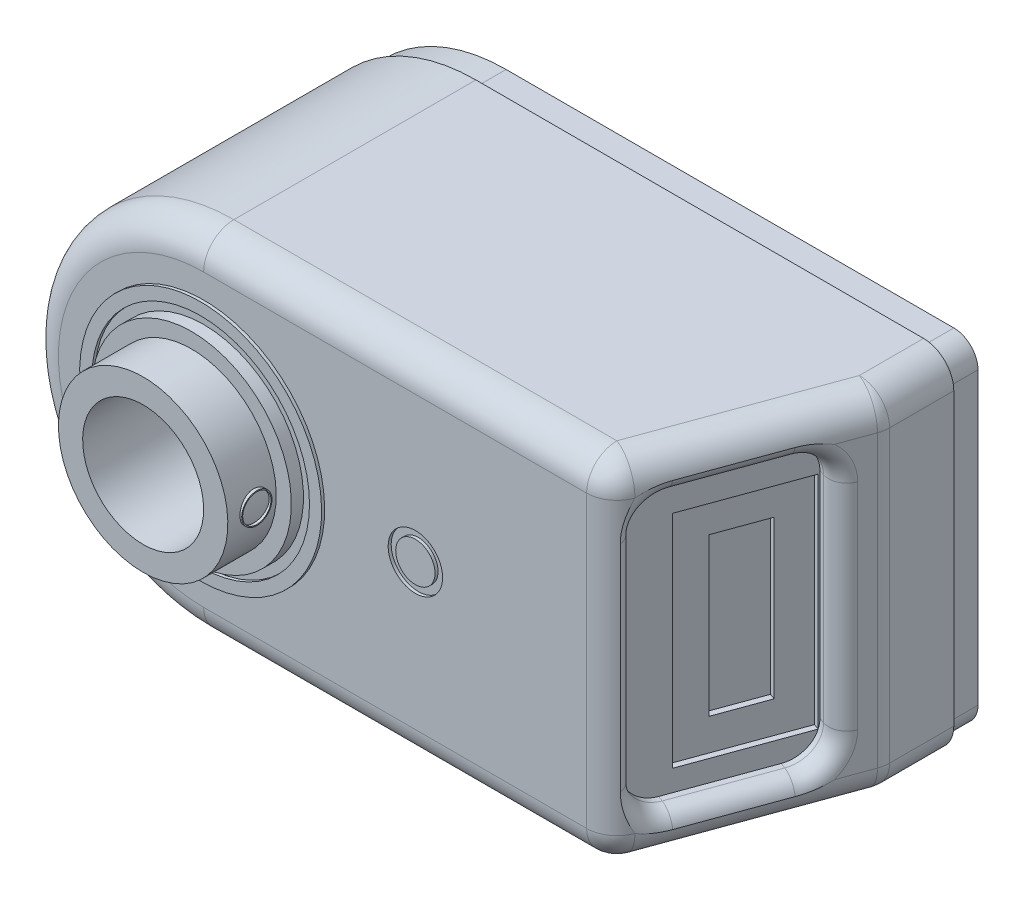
ISO-10303-21;
HEADER;
FILE_DESCRIPTION(('STEP AP214'),'2;1');
FILE_NAME('part.step','',(''),(''),'','','');
FILE_SCHEMA(('AUTOMOTIVE_DESIGN { 1 0 10303 214 1 1 1 1 }'));
ENDSEC;
DATA;
#1=APPLICATION_CONTEXT('core data for automotive mechanical design processes');
#2=APPLICATION_PROTOCOL_DEFINITION('international standard','automotive_design',2000,#1);
#3=PRODUCT_CONTEXT('',#1,'mechanical');
#4=PRODUCT('Part','Part','',(#3));
#5=PRODUCT_RELATED_PRODUCT_CATEGORY('part','',(#4));
#6=PRODUCT_DEFINITION_FORMATION('','',#4);
#7=PRODUCT_DEFINITION_CONTEXT('part definition',#1,'design');
#8=PRODUCT_DEFINITION('design','',#6,#7);
#9=PRODUCT_DEFINITION_SHAPE('','',#8);
#10=(LENGTH_UNIT() NAMED_UNIT(*) SI_UNIT(.MILLI.,.METRE.));
#11=(NAMED_UNIT(*) PLANE_ANGLE_UNIT() SI_UNIT($,.RADIAN.));
#12=(NAMED_UNIT(*) SI_UNIT($,.STERADIAN.) SOLID_ANGLE_UNIT());
#13=UNCERTAINTY_MEASURE_WITH_UNIT(LENGTH_MEASURE(1.E-05),#10,'distance_accuracy_value','');
#14=(GEOMETRIC_REPRESENTATION_CONTEXT(3) GLOBAL_UNCERTAINTY_ASSIGNED_CONTEXT((#13)) GLOBAL_UNIT_ASSIGNED_CONTEXT((#10,
#11,#12)) REPRESENTATION_CONTEXT('',''));
#15=CARTESIAN_POINT('',(0.,0.,0.));
#16=DIRECTION('',(0.,0.,1.));
#17=DIRECTION('',(1.,0.,0.));
#18=AXIS2_PLACEMENT_3D('',#15,#16,#17);
#19=CARTESIAN_POINT('',(74.,-24.,50.));
#20=DIRECTION('',(0.,0.,-1.));
#21=DIRECTION('',(0.,1.,0.));
#22=AXIS2_PLACEMENT_3D('',#19,#20,#21);
#23=CYLINDRICAL_SURFACE('',#22,5.);
#24=DIRECTION('',(0.,0.,-1.));
#25=VECTOR('',#24,1.);
#26=CARTESIAN_POINT('',(79.,-24.,50.));
#27=LINE('',#26,#25);
#28=CARTESIAN_POINT('',(79.,-24.,15.6183729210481));
#29=VERTEX_POINT('',#28);
#30=CARTESIAN_POINT('',(79.,-24.,5.));
#31=VERTEX_POINT('',#30);
#32=EDGE_CURVE('E562',#29,#31,#27,.T.);
#33=ORIENTED_EDGE('',*,*,#32,.F.);
#34=CARTESIAN_POINT('',(74.,-24.,15.6183729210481));
#35=DIRECTION('',(0.,0.,-1.));
#36=DIRECTION('',(0.,1.,0.));
#37=AXIS2_PLACEMENT_3D('',#34,#35,#36);
#38=CIRCLE('',#37,5.);
#39=CARTESIAN_POINT('',(74.,-29.,15.6183729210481));
#40=VERTEX_POINT('',#39);
#41=EDGE_CURVE('E908',#29,#40,#38,.T.);
#42=ORIENTED_EDGE('',*,*,#41,.T.);
#43=DIRECTION('',(0.,0.,-1.));
#44=VECTOR('',#43,1.);
#45=CARTESIAN_POINT('',(74.,-29.,50.));
#46=LINE('',#45,#44);
#47=CARTESIAN_POINT('',(74.,-29.,5.));
#48=VERTEX_POINT('',#47);
#49=EDGE_CURVE('E565',#40,#48,#46,.T.);
#50=ORIENTED_EDGE('',*,*,#49,.T.);
#51=CARTESIAN_POINT('',(74.,-24.,5.));
#52=DIRECTION('',(0.,0.,-1.));
#53=DIRECTION('',(0.,1.,0.));
#54=AXIS2_PLACEMENT_3D('',#51,#52,#53);
#55=CIRCLE('',#54,5.);
#56=EDGE_CURVE('E343',#31,#48,#55,.T.);
#57=ORIENTED_EDGE('',*,*,#56,.F.);
#58=EDGE_LOOP('',(#33,#42,#50,#57));
#59=FACE_BOUND('',#58,.T.);
#60=ADVANCED_FACE('F15',(#59),#23,.T.);
#61=CARTESIAN_POINT('',(79.,24.,50.));
#62=DIRECTION('',(1.,0.,0.));
#63=DIRECTION('',(0.,1.,0.));
#64=AXIS2_PLACEMENT_3D('',#61,#62,#63);
#65=PLANE('',#64);
#66=DIRECTION('',(0.,0.,-1.));
#67=VECTOR('',#66,1.);
#68=CARTESIAN_POINT('',(79.,24.,50.));
#69=LINE('',#68,#67);
#70=CARTESIAN_POINT('',(79.,24.,15.6183729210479));
#71=VERTEX_POINT('',#70);
#72=CARTESIAN_POINT('',(79.,24.,5.));
#73=VERTEX_POINT('',#72);
#74=EDGE_CURVE('E573',#71,#73,#69,.T.);
#75=ORIENTED_EDGE('',*,*,#74,.F.);
#76=DIRECTION('',(0.,-1.,0.));
#77=VECTOR('',#76,1.);
#78=CARTESIAN_POINT('',(79.,-24.,15.6183729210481));
#79=LINE('',#78,#77);
#80=EDGE_CURVE('E930',#71,#29,#79,.T.);
#81=ORIENTED_EDGE('',*,*,#80,.T.);
#82=ORIENTED_EDGE('',*,*,#32,.T.);
#83=DIRECTION('',(0.,-1.,0.));
#84=VECTOR('',#83,1.);
#85=CARTESIAN_POINT('',(79.,24.,5.));
#86=LINE('',#85,#84);
#87=EDGE_CURVE('E358',#73,#31,#86,.T.);
#88=ORIENTED_EDGE('',*,*,#87,.F.);
#89=EDGE_LOOP('',(#75,#81,#82,#88));
#90=FACE_BOUND('',#89,.T.);
#91=ADVANCED_FACE('F625',(#90),#65,.T.);
#92=CARTESIAN_POINT('',(74.,24.,50.));
#93=DIRECTION('',(0.,0.,-1.));
#94=DIRECTION('',(0.,1.,0.));
#95=AXIS2_PLACEMENT_3D('',#92,#93,#94);
#96=CYLINDRICAL_SURFACE('',#95,5.);
#97=DIRECTION('',(0.,0.,-1.));
#98=VECTOR('',#97,1.);
#99=CARTESIAN_POINT('',(74.,29.,50.));
#100=LINE('',#99,#98);
#101=CARTESIAN_POINT('',(74.,29.,15.6183729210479));
#102=VERTEX_POINT('',#101);
#103=CARTESIAN_POINT('',(74.,29.,5.));
#104=VERTEX_POINT('',#103);
#105=EDGE_CURVE('E571',#102,#104,#100,.T.);
#106=ORIENTED_EDGE('',*,*,#105,.F.);
#107=CARTESIAN_POINT('',(74.,24.,15.6183729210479));
#108=DIRECTION('',(0.,0.,-1.));
#109=DIRECTION('',(0.,1.,0.));
#110=AXIS2_PLACEMENT_3D('',#107,#108,#109);
#111=CIRCLE('',#110,5.);
#112=EDGE_CURVE('E928',#102,#71,#111,.T.);
#113=ORIENTED_EDGE('',*,*,#112,.T.);
#114=ORIENTED_EDGE('',*,*,#74,.T.);
#115=CARTESIAN_POINT('',(74.,24.,5.));
#116=DIRECTION('',(0.,0.,-1.));
#117=DIRECTION('',(0.,1.,0.));
#118=AXIS2_PLACEMENT_3D('',#115,#116,#117);
#119=CIRCLE('',#118,5.);
#120=EDGE_CURVE('E355',#104,#73,#119,.T.);
#121=ORIENTED_EDGE('',*,*,#120,.F.);
#122=EDGE_LOOP('',(#106,#113,#114,#121));
#123=FACE_BOUND('',#122,.T.);
#124=ADVANCED_FACE('F632',(#123),#96,.T.);
#125=CARTESIAN_POINT('',(0.,29.,50.));
#126=DIRECTION('',(0.,1.,0.));
#127=DIRECTION('',(0.,0.,1.));
#128=AXIS2_PLACEMENT_3D('',#125,#126,#127);
#129=PLANE('',#128);
#130=DIRECTION('',(1.,0.,0.));
#131=VECTOR('',#130,1.);
#132=CARTESIAN_POINT('',(0.,29.,45.));
#133=LINE('',#132,#131);
#134=CARTESIAN_POINT('',(0.,29.,45.));
#135=VERTEX_POINT('',#134);
#136=CARTESIAN_POINT('',(63.3059623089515,29.,45.));
#137=VERTEX_POINT('',#136);
#138=EDGE_CURVE('E839',#135,#137,#133,.T.);
#139=ORIENTED_EDGE('',*,*,#138,.T.);
#140=DIRECTION('',(0.342020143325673,0.,-0.939692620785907));
#141=VECTOR('',#140,1.);
#142=CARTESIAN_POINT('',(69.3015368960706,29.,28.5272942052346));
#143=LINE('',#142,#141);
#144=EDGE_CURVE('E41',#137,#102,#143,.T.);
#145=ORIENTED_EDGE('',*,*,#144,.T.);
#146=ORIENTED_EDGE('',*,*,#105,.T.);
#147=DIRECTION('',(1.,0.,0.));
#148=VECTOR('',#147,1.);
#149=CARTESIAN_POINT('',(0.,29.,5.));
#150=LINE('',#149,#148);
#151=CARTESIAN_POINT('',(0.,29.,5.));
#152=VERTEX_POINT('',#151);
#153=EDGE_CURVE('E352',#152,#104,#150,.T.);
#154=ORIENTED_EDGE('',*,*,#153,.F.);
#155=DIRECTION('',(0.,0.,-1.));
#156=VECTOR('',#155,1.);
#157=CARTESIAN_POINT('',(0.,29.,50.));
#158=LINE('',#157,#156);
#159=EDGE_CURVE('E569',#135,#152,#158,.T.);
#160=ORIENTED_EDGE('',*,*,#159,.F.);
#161=EDGE_LOOP('',(#139,#145,#146,#154,#160));
#162=FACE_BOUND('',#161,.T.);
#163=ADVANCED_FACE('F648',(#162),#129,.T.);
#164=CARTESIAN_POINT('',(0.,0.,50.));
#165=DIRECTION('',(0.,0.,-1.));
#166=DIRECTION('',(0.,1.,0.));
#167=AXIS2_PLACEMENT_3D('',#164,#165,#166);
#168=CYLINDRICAL_SURFACE('',#167,29.);
#169=DIRECTION('',(0.,0.,-1.));
#170=VECTOR('',#169,1.);
#171=CARTESIAN_POINT('',(0.,-29.,50.));
#172=LINE('',#171,#170);
#173=CARTESIAN_POINT('',(0.,-29.,45.));
#174=VERTEX_POINT('',#173);
#175=CARTESIAN_POINT('',(0.,-29.,5.));
#176=VERTEX_POINT('',#175);
#177=EDGE_CURVE('E567',#174,#176,#172,.T.);
#178=ORIENTED_EDGE('',*,*,#177,.F.);
#179=CARTESIAN_POINT('',(0.,0.,45.));
#180=DIRECTION('',(0.,0.,1.));
#181=DIRECTION('',(0.,-1.,0.));
#182=AXIS2_PLACEMENT_3D('',#179,#180,#181);
#183=CIRCLE('',#182,29.);
#184=EDGE_CURVE('E851',#174,#135,#183,.F.);
#185=ORIENTED_EDGE('',*,*,#184,.T.);
#186=ORIENTED_EDGE('',*,*,#159,.T.);
#187=CARTESIAN_POINT('',(0.,0.,5.));
#188=DIRECTION('',(0.,0.,-1.));
#189=DIRECTION('',(0.,1.,0.));
#190=AXIS2_PLACEMENT_3D('',#187,#188,#189);
#191=CIRCLE('',#190,29.);
#192=EDGE_CURVE('E349',#176,#152,#191,.T.);
#193=ORIENTED_EDGE('',*,*,#192,.F.);
#194=EDGE_LOOP('',(#178,#185,#186,#193));
#195=FACE_BOUND('',#194,.T.);
#196=ADVANCED_FACE('F644',(#195),#168,.T.);
#197=CARTESIAN_POINT('',(74.,-29.,50.));
#198=DIRECTION('',(0.,-1.,0.));
#199=DIRECTION('',(1.,0.,0.));
#200=AXIS2_PLACEMENT_3D('',#197,#198,#199);
#201=PLANE('',#200);
#202=ORIENTED_EDGE('',*,*,#49,.F.);
#203=DIRECTION('',(0.342020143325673,0.,-0.939692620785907));
#204=VECTOR('',#203,1.);
#205=CARTESIAN_POINT('',(63.9283880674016,-29.,43.2898992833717));
#206=LINE('',#205,#204);
#207=CARTESIAN_POINT('',(63.3059623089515,-29.,45.));
#208=VERTEX_POINT('',#207);
#209=EDGE_CURVE('E885',#40,#208,#206,.F.);
#210=ORIENTED_EDGE('',*,*,#209,.T.);
#211=DIRECTION('',(-1.,0.,0.));
#212=VECTOR('',#211,1.);
#213=CARTESIAN_POINT('',(74.,-29.,45.));
#214=LINE('',#213,#212);
#215=EDGE_CURVE('E685',#208,#174,#214,.T.);
#216=ORIENTED_EDGE('',*,*,#215,.T.);
#217=ORIENTED_EDGE('',*,*,#177,.T.);
#218=DIRECTION('',(-1.,0.,0.));
#219=VECTOR('',#218,1.);
#220=CARTESIAN_POINT('',(74.,-29.,5.));
#221=LINE('',#220,#219);
#222=EDGE_CURVE('E346',#48,#176,#221,.T.);
#223=ORIENTED_EDGE('',*,*,#222,.F.);
#224=EDGE_LOOP('',(#202,#210,#216,#217,#223));
#225=FACE_BOUND('',#224,.T.);
#226=ADVANCED_FACE('F640',(#225),#201,.T.);
#227=CARTESIAN_POINT('',(0.,0.,2.));
#228=DIRECTION('',(0.,0.,1.));
#229=DIRECTION('',(0.,-1.,0.));
#230=AXIS2_PLACEMENT_3D('',#227,#228,#229);
#231=CYLINDRICAL_SURFACE('',#230,10.);
#232=CARTESIAN_POINT('',(0.,0.,60.));
#233=DIRECTION('',(0.,0.,1.));
#234=DIRECTION('',(0.,-1.,0.));
#235=AXIS2_PLACEMENT_3D('',#232,#233,#234);
#236=CIRCLE('',#235,10.);
#237=CARTESIAN_POINT('',(0.,-10.,60.));
#238=VERTEX_POINT('',#237);
#239=EDGE_CURVE('E536',#238,#238,#236,.T.);
#240=ORIENTED_EDGE('',*,*,#239,.T.);
#241=EDGE_LOOP('',(#240));
#242=FACE_BOUND('',#241,.T.);
#243=CARTESIAN_POINT('',(0.,0.,25.5));
#244=DIRECTION('',(0.,0.,-1.));
#245=DIRECTION('',(0.,1.,0.));
#246=AXIS2_PLACEMENT_3D('',#243,#244,#245);
#247=CIRCLE('',#246,10.);
#248=CARTESIAN_POINT('',(0.,10.,25.5));
#249=VERTEX_POINT('',#248);
#250=EDGE_CURVE('E511',#249,#249,#247,.T.);
#251=ORIENTED_EDGE('',*,*,#250,.T.);
#252=EDGE_LOOP('',(#251));
#253=FACE_BOUND('',#252,.T.);
#254=ADVANCED_FACE('F643',(#242,#253),#231,.F.);
#255=CARTESIAN_POINT('',(74.,-24.,50.));
#256=DIRECTION('',(0.,0.,1.));
#257=DIRECTION('',(0.,-1.,0.));
#258=AXIS2_PLACEMENT_3D('',#255,#256,#257);
#259=PLANE('',#258);
#260=CARTESIAN_POINT('',(0.,0.,50.));
#261=DIRECTION('',(0.,0.,1.));
#262=DIRECTION('',(0.,-1.,0.));
#263=AXIS2_PLACEMENT_3D('',#260,#261,#262);
#264=CIRCLE('',#263,18.);
#265=CARTESIAN_POINT('',(0.,-18.,50.));
#266=VERTEX_POINT('',#265);
#267=EDGE_CURVE('E551',#266,#266,#264,.T.);
#268=ORIENTED_EDGE('',*,*,#267,.T.);
#269=EDGE_LOOP('',(#268));
#270=FACE_BOUND('',#269,.T.);
#271=CARTESIAN_POINT('',(0.,0.,50.));
#272=DIRECTION('',(0.,0.,1.));
#273=DIRECTION('',(0.,-1.,0.));
#274=AXIS2_PLACEMENT_3D('',#271,#272,#273);
#275=CIRCLE('',#274,16.5);
#276=CARTESIAN_POINT('',(0.,-16.5,50.));
#277=VERTEX_POINT('',#276);
#278=EDGE_CURVE('E545',#277,#277,#275,.T.);
#279=ORIENTED_EDGE('',*,*,#278,.F.);
#280=EDGE_LOOP('',(#279));
#281=FACE_BOUND('',#280,.T.);
#282=ADVANCED_FACE('F1444',(#270,#281),#259,.T.);
#283=DIRECTION('',(0.,-1.,0.));
#284=VECTOR('',#283,1.);
#285=CARTESIAN_POINT('',(63.3059623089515,29.,50.));
#286=LINE('',#285,#284);
#287=CARTESIAN_POINT('',(63.3059623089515,-24.,50.));
#288=VERTEX_POINT('',#287);
#289=CARTESIAN_POINT('',(63.3059623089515,24.,50.));
#290=VERTEX_POINT('',#289);
#291=EDGE_CURVE('E844',#288,#290,#286,.F.);
#292=ORIENTED_EDGE('',*,*,#291,.T.);
#293=DIRECTION('',(1.,0.,0.));
#294=VECTOR('',#293,1.);
#295=CARTESIAN_POINT('',(74.,24.,50.));
#296=LINE('',#295,#294);
#297=CARTESIAN_POINT('',(0.,24.,50.));
#298=VERTEX_POINT('',#297);
#299=EDGE_CURVE('E849',#290,#298,#296,.F.);
#300=ORIENTED_EDGE('',*,*,#299,.T.);
#301=CARTESIAN_POINT('',(0.,0.,50.));
#302=DIRECTION('',(0.,0.,1.));
#303=DIRECTION('',(0.,-1.,0.));
#304=AXIS2_PLACEMENT_3D('',#301,#302,#303);
#305=CIRCLE('',#304,24.);
#306=CARTESIAN_POINT('',(0.,-24.,50.));
#307=VERTEX_POINT('',#306);
#308=EDGE_CURVE('E847',#298,#307,#305,.T.);
#309=ORIENTED_EDGE('',*,*,#308,.T.);
#310=DIRECTION('',(-1.,0.,0.));
#311=VECTOR('',#310,1.);
#312=CARTESIAN_POINT('',(74.,-24.,50.));
#313=LINE('',#312,#311);
#314=EDGE_CURVE('E841',#307,#288,#313,.F.);
#315=ORIENTED_EDGE('',*,*,#314,.T.);
#316=EDGE_LOOP('',(#292,#300,#309,#315));
#317=FACE_BOUND('',#316,.T.);
#318=CARTESIAN_POINT('',(35.,0.,50.));
#319=DIRECTION('',(0.,0.,1.));
#320=DIRECTION('',(0.,-1.,0.));
#321=AXIS2_PLACEMENT_3D('',#318,#319,#320);
#322=CIRCLE('',#321,4.5);
#323=CARTESIAN_POINT('',(35.,-4.5,50.));
#324=VERTEX_POINT('',#323);
#325=EDGE_CURVE('E523',#324,#324,#322,.T.);
#326=ORIENTED_EDGE('',*,*,#325,.F.);
#327=EDGE_LOOP('',(#326));
#328=FACE_BOUND('',#327,.T.);
#329=CARTESIAN_POINT('',(0.,0.,50.));
#330=DIRECTION('',(0.,0.,1.));
#331=DIRECTION('',(0.,-1.,0.));
#332=AXIS2_PLACEMENT_3D('',#329,#330,#331);
#333=CIRCLE('',#332,20.);
#334=CARTESIAN_POINT('',(0.,-20.,50.));
#335=VERTEX_POINT('',#334);
#336=EDGE_CURVE('E558',#335,#335,#333,.T.);
#337=ORIENTED_EDGE('',*,*,#336,.F.);
#338=EDGE_LOOP('',(#337));
#339=FACE_BOUND('',#338,.T.);
#340=ADVANCED_FACE('F638',(#317,#328,#339),#259,.T.);
#341=CARTESIAN_POINT('',(0.,0.,50.5));
#342=DIRECTION('',(0.,0.,1.));
#343=DIRECTION('',(0.,-1.,0.));
#344=AXIS2_PLACEMENT_3D('',#341,#342,#343);
#345=PLANE('',#344);
#346=CARTESIAN_POINT('',(0.,0.,50.5));
#347=DIRECTION('',(0.,0.,1.));
#348=DIRECTION('',(0.,-1.,0.));
#349=AXIS2_PLACEMENT_3D('',#346,#347,#348);
#350=CIRCLE('',#349,20.);
#351=CARTESIAN_POINT('',(0.,-20.,50.5));
#352=VERTEX_POINT('',#351);
#353=EDGE_CURVE('E557',#352,#352,#350,.T.);
#354=ORIENTED_EDGE('',*,*,#353,.T.);
#355=EDGE_LOOP('',(#354));
#356=FACE_BOUND('',#355,.T.);
#357=CARTESIAN_POINT('',(0.,0.,50.5));
#358=DIRECTION('',(0.,0.,1.));
#359=DIRECTION('',(0.,-1.,0.));
#360=AXIS2_PLACEMENT_3D('',#357,#358,#359);
#361=CIRCLE('',#360,18.);
#362=CARTESIAN_POINT('',(0.,-18.,50.5));
#363=VERTEX_POINT('',#362);
#364=EDGE_CURVE('E554',#363,#363,#361,.T.);
#365=ORIENTED_EDGE('',*,*,#364,.F.);
#366=EDGE_LOOP('',(#365));
#367=FACE_BOUND('',#366,.T.);
#368=ADVANCED_FACE('F1508',(#356,#367),#345,.T.);
#369=CARTESIAN_POINT('',(0.,0.,50.5));
#370=DIRECTION('',(0.,0.,-1.));
#371=DIRECTION('',(0.,1.,0.));
#372=AXIS2_PLACEMENT_3D('',#369,#370,#371);
#373=CYLINDRICAL_SURFACE('',#372,20.);
#374=ORIENTED_EDGE('',*,*,#353,.F.);
#375=EDGE_LOOP('',(#374));
#376=FACE_BOUND('',#375,.T.);
#377=ORIENTED_EDGE('',*,*,#336,.T.);
#378=EDGE_LOOP('',(#377));
#379=FACE_BOUND('',#378,.T.);
#380=ADVANCED_FACE('F1498',(#376,#379),#373,.T.);
#381=CARTESIAN_POINT('',(0.,0.,50.5));
#382=DIRECTION('',(0.,0.,-1.));
#383=DIRECTION('',(0.,1.,0.));
#384=AXIS2_PLACEMENT_3D('',#381,#382,#383);
#385=CYLINDRICAL_SURFACE('',#384,18.);
#386=ORIENTED_EDGE('',*,*,#364,.T.);
#387=EDGE_LOOP('',(#386));
#388=FACE_BOUND('',#387,.T.);
#389=ORIENTED_EDGE('',*,*,#267,.F.);
#390=EDGE_LOOP('',(#389));
#391=FACE_BOUND('',#390,.T.);
#392=ADVANCED_FACE('F1487',(#388,#391),#385,.F.);
#393=CARTESIAN_POINT('',(0.,0.,52.));
#394=DIRECTION('',(0.,0.,1.));
#395=DIRECTION('',(0.,-1.,0.));
#396=AXIS2_PLACEMENT_3D('',#393,#394,#395);
#397=PLANE('',#396);
#398=CARTESIAN_POINT('',(0.,0.,52.));
#399=DIRECTION('',(0.,0.,1.));
#400=DIRECTION('',(0.,-1.,0.));
#401=AXIS2_PLACEMENT_3D('',#398,#399,#400);
#402=CIRCLE('',#401,16.5);
#403=CARTESIAN_POINT('',(0.,-16.5,52.));
#404=VERTEX_POINT('',#403);
#405=EDGE_CURVE('E548',#404,#404,#402,.T.);
#406=ORIENTED_EDGE('',*,*,#405,.T.);
#407=EDGE_LOOP('',(#406));
#408=FACE_BOUND('',#407,.T.);
#409=CARTESIAN_POINT('',(0.,0.,52.));
#410=DIRECTION('',(0.,0.,1.));
#411=DIRECTION('',(0.,-1.,0.));
#412=AXIS2_PLACEMENT_3D('',#409,#410,#411);
#413=CIRCLE('',#412,14.);
#414=CARTESIAN_POINT('',(0.,-14.,52.));
#415=VERTEX_POINT('',#414);
#416=EDGE_CURVE('E542',#415,#415,#413,.T.);
#417=ORIENTED_EDGE('',*,*,#416,.F.);
#418=EDGE_LOOP('',(#417));
#419=FACE_BOUND('',#418,.T.);
#420=ADVANCED_FACE('F620',(#408,#419),#397,.T.);
#421=CARTESIAN_POINT('',(0.,0.,52.));
#422=DIRECTION('',(0.,0.,-1.));
#423=DIRECTION('',(0.,1.,0.));
#424=AXIS2_PLACEMENT_3D('',#421,#422,#423);
#425=CYLINDRICAL_SURFACE('',#424,16.5);
#426=ORIENTED_EDGE('',*,*,#405,.F.);
#427=EDGE_LOOP('',(#426));
#428=FACE_BOUND('',#427,.T.);
#429=ORIENTED_EDGE('',*,*,#278,.T.);
#430=EDGE_LOOP('',(#429));
#431=FACE_BOUND('',#430,.T.);
#432=ADVANCED_FACE('F611',(#428,#431),#425,.T.);
#433=CARTESIAN_POINT('',(0.,0.,60.));
#434=DIRECTION('',(0.,0.,1.));
#435=DIRECTION('',(0.,-1.,0.));
#436=AXIS2_PLACEMENT_3D('',#433,#434,#435);
#437=PLANE('',#436);
#438=CARTESIAN_POINT('',(0.,0.,60.));
#439=DIRECTION('',(0.,0.,1.));
#440=DIRECTION('',(0.,-1.,0.));
#441=AXIS2_PLACEMENT_3D('',#438,#439,#440);
#442=CIRCLE('',#441,14.);
#443=CARTESIAN_POINT('',(0.,-14.,60.));
#444=VERTEX_POINT('',#443);
#445=EDGE_CURVE('E539',#444,#444,#442,.T.);
#446=ORIENTED_EDGE('',*,*,#445,.T.);
#447=EDGE_LOOP('',(#446));
#448=FACE_BOUND('',#447,.T.);
#449=ORIENTED_EDGE('',*,*,#239,.F.);
#450=EDGE_LOOP('',(#449));
#451=FACE_BOUND('',#450,.T.);
#452=ADVANCED_FACE('F609',(#448,#451),#437,.T.);
#453=CARTESIAN_POINT('',(0.,0.,60.));
#454=DIRECTION('',(0.,0.,-1.));
#455=DIRECTION('',(0.,1.,0.));
#456=AXIS2_PLACEMENT_3D('',#453,#454,#455);
#457=CYLINDRICAL_SURFACE('',#456,14.);
#458=CARTESIAN_POINT('',(13.999639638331,0.100448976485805,58.));
#459=CARTESIAN_POINT('',(13.9986372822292,0.239800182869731,57.9999945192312));
#460=CARTESIAN_POINT('',(13.9955371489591,0.379209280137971,57.9883092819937));
#461=CARTESIAN_POINT('',(13.9853906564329,0.654076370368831,57.9419169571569));
#462=CARTESIAN_POINT('',(13.978340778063,0.789530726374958,57.9071893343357));
#463=CARTESIAN_POINT('',(13.9610045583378,1.05247420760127,57.8158147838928));
#464=CARTESIAN_POINT('',(13.9507211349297,1.17997039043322,57.759187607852));
#465=CARTESIAN_POINT('',(13.927967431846,1.42362784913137,57.625676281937));
#466=CARTESIAN_POINT('',(13.9154973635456,1.53979021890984,57.5487940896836));
#467=CARTESIAN_POINT('',(13.889522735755,1.75882447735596,57.3760183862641));
#468=CARTESIAN_POINT('',(13.8760088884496,1.86154804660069,57.2799382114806));
#469=CARTESIAN_POINT('',(13.8494973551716,2.04950086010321,57.0718941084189));
#470=CARTESIAN_POINT('',(13.8364997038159,2.13472893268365,56.9599291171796));
#471=CARTESIAN_POINT('',(13.8123494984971,2.28580704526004,56.7223564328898));
#472=CARTESIAN_POINT('',(13.8012098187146,2.35152415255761,56.5966627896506));
#473=CARTESIAN_POINT('',(13.7821380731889,2.46084731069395,56.3357740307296));
#474=CARTESIAN_POINT('',(13.774205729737,2.50445527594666,56.2005797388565));
#475=CARTESIAN_POINT('',(13.7625334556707,2.56782181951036,55.9262157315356));
#476=CARTESIAN_POINT('',(13.7587452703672,2.58785511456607,55.7871115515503));
#477=CARTESIAN_POINT('',(13.755631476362,2.60435754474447,55.5074686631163));
#478=CARTESIAN_POINT('',(13.7563054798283,2.60082872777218,55.3669300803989));
#479=CARTESIAN_POINT('',(13.7619999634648,2.57052175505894,55.0902948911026));
#480=CARTESIAN_POINT('',(13.7669650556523,2.5440398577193,54.9541645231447));
#481=CARTESIAN_POINT('',(13.780611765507,2.46904415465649,54.6883137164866));
#482=CARTESIAN_POINT('',(13.7892935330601,2.42052946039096,54.5585935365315));
#483=CARTESIAN_POINT('',(13.8094836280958,2.30255206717,54.308367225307));
#484=CARTESIAN_POINT('',(13.8210082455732,2.23296809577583,54.1879196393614));
#485=CARTESIAN_POINT('',(13.8456163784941,2.07491791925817,53.960300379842));
#486=CARTESIAN_POINT('',(13.8587000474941,1.98644985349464,53.8531300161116));
#487=CARTESIAN_POINT('',(13.8852532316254,1.79152024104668,53.6533675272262));
#488=CARTESIAN_POINT('',(13.8987255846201,1.68480152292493,53.5610265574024));
#489=CARTESIAN_POINT('',(13.9244195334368,1.45726718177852,53.3955201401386));
#490=CARTESIAN_POINT('',(13.9366411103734,1.33645134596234,53.3223549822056));
#491=CARTESIAN_POINT('',(13.9585631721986,1.08379203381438,53.1971867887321));
#492=CARTESIAN_POINT('',(13.9682586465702,0.951927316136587,53.1452256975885));
#493=CARTESIAN_POINT('',(13.9840783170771,0.681124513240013,53.0642696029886));
#494=CARTESIAN_POINT('',(13.9902028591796,0.542187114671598,53.035272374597));
#495=CARTESIAN_POINT('',(13.9982115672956,0.263208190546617,53.0014034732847));
#496=CARTESIAN_POINT('',(14.0001523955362,0.123207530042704,52.9962083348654));
#497=CARTESIAN_POINT('',(13.999828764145,-0.155689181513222,53.0092412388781));
#498=CARTESIAN_POINT('',(13.9975645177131,-0.294585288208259,53.0274680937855));
#499=CARTESIAN_POINT('',(13.9892020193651,-0.566170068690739,53.0865423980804));
#500=CARTESIAN_POINT('',(13.9831349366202,-0.698899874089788,53.1272056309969));
#501=CARTESIAN_POINT('',(13.9679365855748,-0.955669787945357,53.2298168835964));
#502=CARTESIAN_POINT('',(13.9588051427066,-1.07970940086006,53.2917661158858));
#503=CARTESIAN_POINT('',(13.9384466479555,-1.31681808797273,53.4358361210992));
#504=CARTESIAN_POINT('',(13.9272013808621,-1.4297777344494,53.5181343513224));
#505=CARTESIAN_POINT('',(13.9039680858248,-1.64040241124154,53.7003252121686));
#506=CARTESIAN_POINT('',(13.8919799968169,-1.7380661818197,53.800219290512));
#507=CARTESIAN_POINT('',(13.8684955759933,-1.91651965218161,54.0161903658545));
#508=CARTESIAN_POINT('',(13.8570068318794,-1.99709377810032,54.132446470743));
#509=CARTESIAN_POINT('',(13.8360335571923,-2.1375784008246,54.3770050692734));
#510=CARTESIAN_POINT('',(13.8265489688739,-2.19748949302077,54.5053072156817));
#511=CARTESIAN_POINT('',(13.8107499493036,-2.29469354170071,54.7698765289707));
#512=CARTESIAN_POINT('',(13.8044242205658,-2.33206720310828,54.906113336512));
#513=CARTESIAN_POINT('',(13.7956596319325,-2.38337247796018,55.1830495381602));
#514=CARTESIAN_POINT('',(13.7932204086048,-2.39730628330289,55.3237485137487));
#515=CARTESIAN_POINT('',(13.7925309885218,-2.40126849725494,55.6036165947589));
#516=CARTESIAN_POINT('',(13.7942255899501,-2.3916119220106,55.7427812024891));
#517=CARTESIAN_POINT('',(13.8014850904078,-2.34935338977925,56.0174736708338));
#518=CARTESIAN_POINT('',(13.8070499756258,-2.31675151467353,56.1530015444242));
#519=CARTESIAN_POINT('',(13.8213807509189,-2.22965537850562,56.416424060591));
#520=CARTESIAN_POINT('',(13.8301420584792,-2.17519244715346,56.5443293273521));
#521=CARTESIAN_POINT('',(13.8498497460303,-2.04595120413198,56.7892404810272));
#522=CARTESIAN_POINT('',(13.8607962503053,-1.97117173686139,56.9062457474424));
#523=CARTESIAN_POINT('',(13.8837691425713,-1.8023003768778,57.1276272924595));
#524=CARTESIAN_POINT('',(13.8958074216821,-1.70797653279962,57.2318254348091));
#525=CARTESIAN_POINT('',(13.9194491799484,-1.50317593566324,57.4230222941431));
#526=CARTESIAN_POINT('',(13.9310525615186,-1.39269558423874,57.5100171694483));
#527=CARTESIAN_POINT('',(13.9525442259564,-1.15780057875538,57.6648877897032));
#528=CARTESIAN_POINT('',(13.9624200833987,-1.03329478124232,57.7326270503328));
#529=CARTESIAN_POINT('',(13.9791569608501,-0.774541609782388,57.8461267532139));
#530=CARTESIAN_POINT('',(13.9860209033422,-0.640303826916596,57.8919085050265));
#531=CARTESIAN_POINT('',(13.9945017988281,-0.404590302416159,57.9505664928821));
#532=CARTESIAN_POINT('',(13.9970512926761,-0.304511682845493,57.9690748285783));
#533=CARTESIAN_POINT('',(13.9999857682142,-0.102815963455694,57.9937934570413));
#534=CARTESIAN_POINT('',(14.0003707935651,-0.00119889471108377,58.0000039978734));
#535=CARTESIAN_POINT('',(13.999639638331,0.100448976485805,58.));
#536=B_SPLINE_CURVE_WITH_KNOTS('',3,(#458,#459,#460,#461,#462,#463,#464,#465,#466,#467,#468,
#469,#470,#471,#472,#473,#474,#475,#476,#477,#478,#479,#480,#481,#482,#483,#484,#485,#486,#487,
#488,#489,#490,#491,#492,#493,#494,#495,#496,#497,#498,#499,#500,#501,#502,#503,#504,#505,#506,
#507,#508,#509,#510,#511,#512,#513,#514,#515,#516,#517,#518,#519,#520,#521,#522,#523,#524,#525,
#526,#527,#528,#529,#530,#531,#532,#533,#534,#535),.UNSPECIFIED.,.T.,.F.,(4,2,2,2,2,2,2,2,2,2,2,
2,2,2,2,2,2,2,2,2,2,2,2,2,2,2,2,2,2,2,2,2,2,2,2,2,2,2,4),(0.,0.417692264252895,
0.835757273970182,1.25344609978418,1.67109457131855,2.09302094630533,2.51497556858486,
2.93974235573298,3.36447235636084,3.78420234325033,4.20389584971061,4.61825164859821,
5.03262415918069,5.44942861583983,5.86627415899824,6.28956788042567,6.71286799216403,
7.13700143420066,7.56109377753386,7.97940535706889,8.39769572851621,8.81260171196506,
9.22753133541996,9.64621560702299,10.0649343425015,10.4886563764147,10.912366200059,
11.3345495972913,11.7566935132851,12.1732311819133,12.5897673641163,13.0057087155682,
13.4216737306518,13.8428915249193,14.2642032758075,14.6884307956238,15.1122457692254,
15.4169319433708,15.72161197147),.UNSPECIFIED.);
#537=CARTESIAN_POINT('',(13.999639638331,0.100448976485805,58.));
#538=VERTEX_POINT('',#537);
#539=EDGE_CURVE('E535',#538,#538,#536,.T.);
#540=ORIENTED_EDGE('',*,*,#539,.T.);
#541=EDGE_LOOP('',(#540));
#542=FACE_BOUND('',#541,.T.);
#543=ORIENTED_EDGE('',*,*,#416,.T.);
#544=EDGE_LOOP('',(#543));
#545=FACE_BOUND('',#544,.T.);
#546=ORIENTED_EDGE('',*,*,#445,.F.);
#547=EDGE_LOOP('',(#546));
#548=FACE_BOUND('',#547,.T.);
#549=ADVANCED_FACE('F589',(#542,#545,#548),#457,.T.);
#550=CARTESIAN_POINT('',(13.293165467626,0.100448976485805,55.5));
#551=DIRECTION('',(1.,0.,0.));
#552=DIRECTION('',(0.,0.,1.));
#553=AXIS2_PLACEMENT_3D('',#550,#551,#552);
#554=CYLINDRICAL_SURFACE('',#553,2.5);
#555=CARTESIAN_POINT('',(14.293165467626,0.100448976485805,55.5));
#556=DIRECTION('',(1.,0.,0.));
#557=DIRECTION('',(0.,0.,1.));
#558=AXIS2_PLACEMENT_3D('',#555,#556,#557);
#559=CIRCLE('',#558,2.5);
#560=CARTESIAN_POINT('',(14.293165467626,0.100448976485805,58.));
#561=VERTEX_POINT('',#560);
#562=EDGE_CURVE('E532',#561,#561,#559,.T.);
#563=ORIENTED_EDGE('',*,*,#562,.F.);
#564=EDGE_LOOP('',(#563));
#565=FACE_BOUND('',#564,.T.);
#566=ORIENTED_EDGE('',*,*,#539,.F.);
#567=EDGE_LOOP('',(#566));
#568=FACE_BOUND('',#567,.T.);
#569=ADVANCED_FACE('F599',(#565,#568),#554,.T.);
#570=CARTESIAN_POINT('',(13.293165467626,0.100448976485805,55.5));
#571=DIRECTION('',(1.,0.,0.));
#572=DIRECTION('',(0.,0.,1.));
#573=AXIS2_PLACEMENT_3D('',#570,#571,#572);
#574=CYLINDRICAL_SURFACE('',#573,2.34);
#575=CARTESIAN_POINT('',(14.293165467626,0.100448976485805,55.5));
#576=DIRECTION('',(1.,0.,0.));
#577=DIRECTION('',(0.,0.,1.));
#578=AXIS2_PLACEMENT_3D('',#575,#576,#577);
#579=CIRCLE('',#578,2.34);
#580=CARTESIAN_POINT('',(14.293165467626,0.100448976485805,57.84));
#581=VERTEX_POINT('',#580);
#582=EDGE_CURVE('E529',#581,#581,#579,.T.);
#583=ORIENTED_EDGE('',*,*,#582,.T.);
#584=EDGE_LOOP('',(#583));
#585=FACE_BOUND('',#584,.T.);
#586=CARTESIAN_POINT('',(13.999639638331,0.100448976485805,57.84));
#587=CARTESIAN_POINT('',(13.9987005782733,0.231011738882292,57.8399947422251));
#588=CARTESIAN_POINT('',(13.9959199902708,0.361632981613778,57.8290356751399));
#589=CARTESIAN_POINT('',(13.9868961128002,0.619184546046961,57.7855201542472));
#590=CARTESIAN_POINT('',(13.9806495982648,0.74611131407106,57.7529435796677));
#591=CARTESIAN_POINT('',(13.9653195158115,0.99251178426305,57.6672149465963));
#592=CARTESIAN_POINT('',(13.9562383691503,1.11199174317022,57.6140804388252));
#593=CARTESIAN_POINT('',(13.9361653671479,1.3403161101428,57.4887909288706));
#594=CARTESIAN_POINT('',(13.9251737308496,1.44916173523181,57.4166381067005));
#595=CARTESIAN_POINT('',(13.9023106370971,1.65424202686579,57.2545825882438));
#596=CARTESIAN_POINT('',(13.8904321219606,1.75035374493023,57.1645252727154));
#597=CARTESIAN_POINT('',(13.8671464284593,1.92617084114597,56.9695486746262));
#598=CARTESIAN_POINT('',(13.8557392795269,2.00587519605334,56.8646284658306));
#599=CARTESIAN_POINT('',(13.8345703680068,2.14704570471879,56.6421453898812));
#600=CARTESIAN_POINT('',(13.8248184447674,2.20840434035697,56.5245132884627));
#601=CARTESIAN_POINT('',(13.8081338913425,2.31043900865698,56.2804098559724));
#602=CARTESIAN_POINT('',(13.801201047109,2.35111661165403,56.1539391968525));
#603=CARTESIAN_POINT('',(13.7910017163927,2.41022212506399,55.8971467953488));
#604=CARTESIAN_POINT('',(13.7876977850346,2.42887742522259,55.7668789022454));
#605=CARTESIAN_POINT('',(13.7850050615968,2.44411526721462,55.5050231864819));
#606=CARTESIAN_POINT('',(13.7856159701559,2.44069949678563,55.3734354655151));
#607=CARTESIAN_POINT('',(13.7906533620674,2.41206980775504,55.1142218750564));
#608=CARTESIAN_POINT('',(13.7950372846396,2.38709902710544,54.9865682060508));
#609=CARTESIAN_POINT('',(13.8070754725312,2.31644977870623,54.737291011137));
#610=CARTESIAN_POINT('',(13.8147298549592,2.27077056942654,54.6156677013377));
#611=CARTESIAN_POINT('',(13.8325201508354,2.15975615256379,54.3811745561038));
#612=CARTESIAN_POINT('',(13.8426687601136,2.09431997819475,54.2683535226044));
#613=CARTESIAN_POINT('',(13.8643346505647,1.9457248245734,54.0552026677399));
#614=CARTESIAN_POINT('',(13.8758520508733,1.86256430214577,53.954873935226));
#615=CARTESIAN_POINT('',(13.8991995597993,1.67954086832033,53.7681247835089));
#616=CARTESIAN_POINT('',(13.9110317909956,1.57946632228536,53.6819119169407));
#617=CARTESIAN_POINT('',(13.9335943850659,1.36617335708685,53.5274690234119));
#618=CARTESIAN_POINT('',(13.9443247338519,1.25295476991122,53.4592392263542));
#619=CARTESIAN_POINT('',(13.9635685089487,1.01629504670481,53.342627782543));
#620=CARTESIAN_POINT('',(13.9720781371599,0.89283686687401,53.2942800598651));
#621=CARTESIAN_POINT('',(13.9859677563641,0.639373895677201,53.2190723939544));
#622=CARTESIAN_POINT('',(13.9913480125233,0.509369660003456,53.1922106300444));
#623=CARTESIAN_POINT('',(13.9984024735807,0.248172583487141,53.1610109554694));
#624=CARTESIAN_POINT('',(14.0001203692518,0.117012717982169,53.1564066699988));
#625=CARTESIAN_POINT('',(13.9998664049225,-0.144227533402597,53.1691559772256));
#626=CARTESIAN_POINT('',(13.9978947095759,-0.274307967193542,53.1865085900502));
#627=CARTESIAN_POINT('',(13.9905869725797,-0.528744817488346,53.2424429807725));
#628=CARTESIAN_POINT('',(13.9852748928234,-0.653135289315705,53.2808733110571));
#629=CARTESIAN_POINT('',(13.9719647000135,-0.893717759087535,53.3777252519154));
#630=CARTESIAN_POINT('',(13.9639664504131,-1.00990933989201,53.436147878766));
#631=CARTESIAN_POINT('',(13.9461509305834,-1.23181964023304,53.5718633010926));
#632=CARTESIAN_POINT('',(13.9363196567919,-1.33744740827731,53.6493029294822));
#633=CARTESIAN_POINT('',(13.9160236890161,-1.53430643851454,53.820653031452));
#634=CARTESIAN_POINT('',(13.9055589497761,-1.62553667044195,53.9145646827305));
#635=CARTESIAN_POINT('',(13.8850973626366,-1.79198039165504,54.1173594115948));
#636=CARTESIAN_POINT('',(13.875106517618,-1.86701731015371,54.2263881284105));
#637=CARTESIAN_POINT('',(13.8568933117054,-1.99771883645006,54.4556344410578));
#638=CARTESIAN_POINT('',(13.8486709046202,-2.05338395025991,54.5758517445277));
#639=CARTESIAN_POINT('',(13.8350019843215,-2.14355008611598,54.8236877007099));
#640=CARTESIAN_POINT('',(13.8295465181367,-2.1781194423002,54.9512809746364));
#641=CARTESIAN_POINT('',(13.8220313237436,-2.22531590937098,55.2105574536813));
#642=CARTESIAN_POINT('',(13.8199713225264,-2.23794478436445,55.342240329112));
#643=CARTESIAN_POINT('',(13.819499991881,-2.24085254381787,55.6043335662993));
#644=CARTESIAN_POINT('',(13.8210468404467,-2.23138760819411,55.7347410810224));
#645=CARTESIAN_POINT('',(13.8275173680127,-2.19093047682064,55.992083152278));
#646=CARTESIAN_POINT('',(13.8324410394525,-2.15993832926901,56.1190177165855));
#647=CARTESIAN_POINT('',(13.8450755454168,-2.07740467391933,56.36571028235));
#648=CARTESIAN_POINT('',(13.8527833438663,-2.0258855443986,56.4854759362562));
#649=CARTESIAN_POINT('',(13.8700897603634,-1.90378452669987,56.7147076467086));
#650=CARTESIAN_POINT('',(13.8796884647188,-1.83320176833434,56.8241732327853));
#651=CARTESIAN_POINT('',(13.8997852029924,-1.67405401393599,57.0309971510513));
#652=CARTESIAN_POINT('',(13.9102919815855,-1.58529943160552,57.1282087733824));
#653=CARTESIAN_POINT('',(13.9308894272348,-1.39272302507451,57.3064476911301));
#654=CARTESIAN_POINT('',(13.9409800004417,-1.28889782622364,57.3874713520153));
#655=CARTESIAN_POINT('',(13.9596143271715,-1.06839648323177,57.5314638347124));
#656=CARTESIAN_POINT('',(13.9681486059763,-0.95164815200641,57.5943233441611));
#657=CARTESIAN_POINT('',(13.9825531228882,-0.709156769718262,57.6994468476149));
#658=CARTESIAN_POINT('',(13.9884260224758,-0.583422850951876,57.741731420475));
#659=CARTESIAN_POINT('',(13.9955568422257,-0.364251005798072,57.7953012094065));
#660=CARTESIAN_POINT('',(13.9976624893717,-0.272134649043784,57.8120376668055));
#661=CARTESIAN_POINT('',(14.0000401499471,-0.0865391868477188,57.8343888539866));
#662=CARTESIAN_POINT('',(14.0003121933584,0.00693989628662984,57.8400037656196));
#663=CARTESIAN_POINT('',(13.999639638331,0.100448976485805,57.84));
#664=B_SPLINE_CURVE_WITH_KNOTS('',3,(#586,#587,#588,#589,#590,#591,#592,#593,#594,#595,#596,
#597,#598,#599,#600,#601,#602,#603,#604,#605,#606,#607,#608,#609,#610,#611,#612,#613,#614,#615,
#616,#617,#618,#619,#620,#621,#622,#623,#624,#625,#626,#627,#628,#629,#630,#631,#632,#633,#634,
#635,#636,#637,#638,#639,#640,#641,#642,#643,#644,#645,#646,#647,#648,#649,#650,#651,#652,#653,
#654,#655,#656,#657,#658,#659,#660,#661,#662,#663),.UNSPECIFIED.,.T.,.F.,(4,2,2,2,2,2,2,2,2,2,2,
2,2,2,2,2,2,2,2,2,2,2,2,2,2,2,2,2,2,2,2,2,2,2,2,2,2,2,4),(0.,0.391356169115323,0.78307710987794,
1.17446436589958,1.56580677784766,1.96068827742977,2.35559439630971,2.75277149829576,
3.14991843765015,3.54292776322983,3.93590703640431,4.32451062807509,4.71312813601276,
5.1037662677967,5.49443842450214,5.89042003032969,6.2864066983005,6.6830662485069,
7.07969218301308,7.47155939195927,7.86340911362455,8.25247951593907,8.64156969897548,
9.03376415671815,9.42598666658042,9.8222911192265,10.2185852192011,10.6135887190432,
11.0085604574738,11.3989752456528,11.7893891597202,12.1793786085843,12.5693858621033,
12.9636908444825,13.3580842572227,13.7548039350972,14.1511259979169,14.4314199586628,
14.7117093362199),.UNSPECIFIED.);
#665=CARTESIAN_POINT('',(13.999639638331,0.100448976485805,57.84));
#666=VERTEX_POINT('',#665);
#667=EDGE_CURVE('E561',#666,#666,#664,.T.);
#668=ORIENTED_EDGE('',*,*,#667,.T.);
#669=EDGE_LOOP('',(#668));
#670=FACE_BOUND('',#669,.T.);
#671=ADVANCED_FACE('F593',(#585,#670),#574,.F.);
#672=CARTESIAN_POINT('',(14.293165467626,0.100448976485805,55.5));
#673=DIRECTION('',(1.,0.,0.));
#674=DIRECTION('',(0.,0.,1.));
#675=AXIS2_PLACEMENT_3D('',#672,#673,#674);
#676=PLANE('',#675);
#677=ORIENTED_EDGE('',*,*,#582,.F.);
#678=EDGE_LOOP('',(#677));
#679=FACE_BOUND('',#678,.T.);
#680=ORIENTED_EDGE('',*,*,#562,.T.);
#681=EDGE_LOOP('',(#680));
#682=FACE_BOUND('',#681,.T.);
#683=ADVANCED_FACE('F598',(#679,#682),#676,.T.);
#684=ORIENTED_EDGE('',*,*,#667,.F.);
#685=EDGE_LOOP('',(#684));
#686=FACE_BOUND('',#685,.T.);
#687=ADVANCED_FACE('F604',(#686),#457,.T.);
#688=CARTESIAN_POINT('',(35.,0.,49.5));
#689=DIRECTION('',(0.,0.,1.));
#690=DIRECTION('',(0.,-1.,0.));
#691=AXIS2_PLACEMENT_3D('',#688,#689,#690);
#692=CYLINDRICAL_SURFACE('',#691,4.5);
#693=CARTESIAN_POINT('',(35.,0.,49.5));
#694=DIRECTION('',(0.,0.,1.));
#695=DIRECTION('',(0.,-1.,0.));
#696=AXIS2_PLACEMENT_3D('',#693,#694,#695);
#697=CIRCLE('',#696,4.5);
#698=CARTESIAN_POINT('',(35.,-4.5,49.5));
#699=VERTEX_POINT('',#698);
#700=EDGE_CURVE('E526',#699,#699,#697,.T.);
#701=ORIENTED_EDGE('',*,*,#700,.F.);
#702=EDGE_LOOP('',(#701));
#703=FACE_BOUND('',#702,.T.);
#704=ORIENTED_EDGE('',*,*,#325,.T.);
#705=EDGE_LOOP('',(#704));
#706=FACE_BOUND('',#705,.T.);
#707=ADVANCED_FACE('F601',(#703,#706),#692,.F.);
#708=CARTESIAN_POINT('',(35.,0.,49.5));
#709=DIRECTION('',(0.,0.,1.));
#710=DIRECTION('',(0.,-1.,0.));
#711=AXIS2_PLACEMENT_3D('',#708,#709,#710);
#712=PLANE('',#711);
#713=CARTESIAN_POINT('',(35.,0.,49.5));
#714=DIRECTION('',(0.,0.,1.));
#715=DIRECTION('',(0.,-1.,0.));
#716=AXIS2_PLACEMENT_3D('',#713,#714,#715);
#717=CIRCLE('',#716,3.25);
#718=CARTESIAN_POINT('',(35.,-3.25,49.5));
#719=VERTEX_POINT('',#718);
#720=EDGE_CURVE('E520',#719,#719,#717,.T.);
#721=ORIENTED_EDGE('',*,*,#720,.F.);
#722=EDGE_LOOP('',(#721));
#723=FACE_BOUND('',#722,.T.);
#724=ORIENTED_EDGE('',*,*,#700,.T.);
#725=EDGE_LOOP('',(#724));
#726=FACE_BOUND('',#725,.T.);
#727=ADVANCED_FACE('F1452',(#723,#726),#712,.T.);
#728=CARTESIAN_POINT('',(35.,0.,49.5));
#729=DIRECTION('',(0.,0.,1.));
#730=DIRECTION('',(0.,-1.,0.));
#731=AXIS2_PLACEMENT_3D('',#728,#729,#730);
#732=CYLINDRICAL_SURFACE('',#731,3.25);
#733=ORIENTED_EDGE('',*,*,#720,.T.);
#734=EDGE_LOOP('',(#733));
#735=FACE_BOUND('',#734,.T.);
#736=CARTESIAN_POINT('',(35.,0.,50.));
#737=DIRECTION('',(0.,0.,1.));
#738=DIRECTION('',(0.,-1.,0.));
#739=AXIS2_PLACEMENT_3D('',#736,#737,#738);
#740=CIRCLE('',#739,3.25);
#741=CARTESIAN_POINT('',(35.,-3.25,50.));
#742=VERTEX_POINT('',#741);
#743=EDGE_CURVE('E517',#742,#742,#740,.T.);
#744=ORIENTED_EDGE('',*,*,#743,.F.);
#745=EDGE_LOOP('',(#744));
#746=FACE_BOUND('',#745,.T.);
#747=ADVANCED_FACE('F1442',(#735,#746),#732,.T.);
#748=ORIENTED_EDGE('',*,*,#743,.T.);
#749=EDGE_LOOP('',(#748));
#750=FACE_BOUND('',#749,.T.);
#751=ADVANCED_FACE('F1425',(#750),#259,.T.);
#752=CARTESIAN_POINT('',(0.,0.,25.5));
#753=DIRECTION('',(0.,0.,-1.));
#754=DIRECTION('',(0.,1.,0.));
#755=AXIS2_PLACEMENT_3D('',#752,#753,#754);
#756=CYLINDRICAL_SURFACE('',#755,18.5);
#757=CARTESIAN_POINT('',(0.,0.,25.5));
#758=DIRECTION('',(0.,0.,-1.));
#759=DIRECTION('',(0.,1.,0.));
#760=AXIS2_PLACEMENT_3D('',#757,#758,#759);
#761=CIRCLE('',#760,18.5);
#762=CARTESIAN_POINT('',(0.,18.5,25.5));
#763=VERTEX_POINT('',#762);
#764=EDGE_CURVE('E514',#763,#763,#761,.T.);
#765=ORIENTED_EDGE('',*,*,#764,.F.);
#766=EDGE_LOOP('',(#765));
#767=FACE_BOUND('',#766,.T.);
#768=CARTESIAN_POINT('',(0.,0.,0.));
#769=DIRECTION('',(0.,0.,-1.));
#770=DIRECTION('',(0.,1.,0.));
#771=AXIS2_PLACEMENT_3D('',#768,#769,#770);
#772=CIRCLE('',#771,18.5);
#773=CARTESIAN_POINT('',(0.,18.5,0.));
#774=VERTEX_POINT('',#773);
#775=EDGE_CURVE('E298',#774,#774,#772,.T.);
#776=ORIENTED_EDGE('',*,*,#775,.T.);
#777=EDGE_LOOP('',(#776));
#778=FACE_BOUND('',#777,.T.);
#779=ADVANCED_FACE('F1415',(#767,#778),#756,.F.);
#780=CARTESIAN_POINT('',(0.,0.,25.5));
#781=DIRECTION('',(0.,0.,-1.));
#782=DIRECTION('',(0.,1.,0.));
#783=AXIS2_PLACEMENT_3D('',#780,#781,#782);
#784=PLANE('',#783);
#785=ORIENTED_EDGE('',*,*,#250,.F.);
#786=EDGE_LOOP('',(#785));
#787=FACE_BOUND('',#786,.T.);
#788=ORIENTED_EDGE('',*,*,#764,.T.);
#789=EDGE_LOOP('',(#788));
#790=FACE_BOUND('',#789,.T.);
#791=ADVANCED_FACE('F1413',(#787,#790),#784,.T.);
#792=CARTESIAN_POINT('',(66.807,29.,50.));
#793=DIRECTION('',(-0.939692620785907,0.,-0.342020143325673));
#794=DIRECTION('',(0.342020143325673,0.,-0.939692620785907));
#795=AXIS2_PLACEMENT_3D('',#792,#793,#794);
#796=PLANE('',#795);
#797=CARTESIAN_POINT('',(75.0909381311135,-17.75,27.2400670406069));
#798=DIRECTION('',(-0.939692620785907,0.,-0.342020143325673));
#799=DIRECTION('',(0.342020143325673,0.,-0.939692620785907));
#800=AXIS2_PLACEMENT_3D('',#797,#798,#799);
#801=CIRCLE('',#800,8.);
#802=CARTESIAN_POINT('',(77.827099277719,-17.75,19.7225260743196));
#803=VERTEX_POINT('',#802);
#804=CARTESIAN_POINT('',(76.7988998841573,-24.,22.5474806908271));
#805=VERTEX_POINT('',#804);
#806=EDGE_CURVE('E583',#803,#805,#801,.T.);
#807=ORIENTED_EDGE('',*,*,#806,.T.);
#808=DIRECTION('',(0.342020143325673,0.,-0.939692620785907));
#809=VECTOR('',#808,1.);
#810=CARTESIAN_POINT('',(74.,-24.,30.2373949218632));
#811=LINE('',#810,#809);
#812=CARTESIAN_POINT('',(78.6984631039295,-24.,17.3284736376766));
#813=VERTEX_POINT('',#812);
#814=EDGE_CURVE('E909',#805,#813,#811,.T.);
#815=ORIENTED_EDGE('',*,*,#814,.T.);
#816=DIRECTION('',(0.,-1.,0.));
#817=VECTOR('',#816,1.);
#818=CARTESIAN_POINT('',(78.6984631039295,24.,17.3284736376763));
#819=LINE('',#818,#817);
#820=CARTESIAN_POINT('',(78.6984631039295,24.,17.3284736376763));
#821=VERTEX_POINT('',#820);
#822=EDGE_CURVE('E934',#813,#821,#819,.F.);
#823=ORIENTED_EDGE('',*,*,#822,.T.);
#824=DIRECTION('',(0.342020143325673,0.,-0.939692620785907));
#825=VECTOR('',#824,1.);
#826=CARTESIAN_POINT('',(68.6268511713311,24.,45.));
#827=LINE('',#826,#825);
#828=CARTESIAN_POINT('',(76.7988998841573,24.,22.5474806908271));
#829=VERTEX_POINT('',#828);
#830=EDGE_CURVE('E734',#821,#829,#827,.F.);
#831=ORIENTED_EDGE('',*,*,#830,.T.);
#832=CARTESIAN_POINT('',(75.0909381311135,17.75,27.2400670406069));
#833=DIRECTION('',(-0.939692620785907,0.,-0.342020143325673));
#834=DIRECTION('',(0.342020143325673,0.,-0.939692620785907));
#835=AXIS2_PLACEMENT_3D('',#832,#833,#834);
#836=CIRCLE('',#835,8.);
#837=CARTESIAN_POINT('',(77.827099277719,17.75,19.7225260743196));
#838=VERTEX_POINT('',#837);
#839=EDGE_CURVE('E814',#829,#838,#836,.T.);
#840=ORIENTED_EDGE('',*,*,#839,.T.);
#841=DIRECTION('',(0.,-1.,0.));
#842=VECTOR('',#841,1.);
#843=CARTESIAN_POINT('',(77.827099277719,29.,19.7225260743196));
#844=LINE('',#843,#842);
#845=EDGE_CURVE('E805',#838,#803,#844,.T.);
#846=ORIENTED_EDGE('',*,*,#845,.T.);
#847=EDGE_LOOP('',(#807,#815,#823,#831,#840,#846));
#848=FACE_BOUND('',#847,.T.);
#849=ADVANCED_FACE('F935',(#848),#796,.F.);
#850=CARTESIAN_POINT('',(71.33216764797,-17.75,25.8719864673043));
#851=DIRECTION('',(0.939692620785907,0.,0.342020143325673));
#852=DIRECTION('',(-0.342020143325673,0.,0.939692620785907));
#853=AXIS2_PLACEMENT_3D('',#850,#851,#852);
#854=CYLINDRICAL_SURFACE('',#853,5.);
#855=DIRECTION('',(0.939692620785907,0.,0.342020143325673));
#856=VECTOR('',#855,1.);
#857=CARTESIAN_POINT('',(71.33216764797,-22.75,25.8719864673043));
#858=LINE('',#857,#856);
#859=CARTESIAN_POINT('',(71.33216764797,-22.75,25.8719864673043));
#860=VERTEX_POINT('',#859);
#861=CARTESIAN_POINT('',(72.271860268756,-22.75,26.2140066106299));
#862=VERTEX_POINT('',#861);
#863=EDGE_CURVE('E490',#860,#862,#858,.T.);
#864=ORIENTED_EDGE('',*,*,#863,.T.);
#865=CARTESIAN_POINT('',(72.271860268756,-17.75,26.2140066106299));
#866=DIRECTION('',(-0.939692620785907,0.,-0.342020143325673));
#867=DIRECTION('',(0.342020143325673,0.,-0.939692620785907));
#868=AXIS2_PLACEMENT_3D('',#865,#866,#867);
#869=CIRCLE('',#868,5.);
#870=CARTESIAN_POINT('',(73.981960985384,-17.75,21.5155435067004));
#871=VERTEX_POINT('',#870);
#872=EDGE_CURVE('E809',#862,#871,#869,.F.);
#873=ORIENTED_EDGE('',*,*,#872,.T.);
#874=DIRECTION('',(0.939692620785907,0.,0.342020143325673));
#875=VECTOR('',#874,1.);
#876=CARTESIAN_POINT('',(73.0422683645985,-17.75,21.1735233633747));
#877=LINE('',#876,#875);
#878=CARTESIAN_POINT('',(73.0422683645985,-17.75,21.1735233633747));
#879=VERTEX_POINT('',#878);
#880=EDGE_CURVE('E469',#879,#871,#877,.T.);
#881=ORIENTED_EDGE('',*,*,#880,.F.);
#882=CARTESIAN_POINT('',(71.33216764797,-17.75,25.8719864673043));
#883=DIRECTION('',(0.939692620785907,0.,0.342020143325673));
#884=DIRECTION('',(-0.342020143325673,0.,0.939692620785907));
#885=AXIS2_PLACEMENT_3D('',#882,#883,#884);
#886=CIRCLE('',#885,5.);
#887=EDGE_CURVE('E445',#860,#879,#886,.T.);
#888=ORIENTED_EDGE('',*,*,#887,.F.);
#889=EDGE_LOOP('',(#864,#873,#881,#888));
#890=FACE_BOUND('',#889,.T.);
#891=ADVANCED_FACE('F1396',(#890),#854,.F.);
#892=CARTESIAN_POINT('',(71.33216764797,-22.75,25.8719864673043));
#893=DIRECTION('',(0.,1.,0.));
#894=DIRECTION('',(-1.,0.,0.));
#895=AXIS2_PLACEMENT_3D('',#892,#893,#894);
#896=PLANE('',#895);
#897=DIRECTION('',(0.939692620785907,0.,0.342020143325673));
#898=VECTOR('',#897,1.);
#899=CARTESIAN_POINT('',(65.9282493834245,-22.75,40.7191298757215));
#900=LINE('',#899,#898);
#901=CARTESIAN_POINT('',(65.9282493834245,-22.75,40.7191298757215));
#902=VERTEX_POINT('',#901);
#903=CARTESIAN_POINT('',(66.86794200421,-22.75,41.0611500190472));
#904=VERTEX_POINT('',#903);
#905=EDGE_CURVE('E487',#902,#904,#900,.T.);
#906=ORIENTED_EDGE('',*,*,#905,.T.);
#907=DIRECTION('',(-0.342020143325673,0.,0.939692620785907));
#908=VECTOR('',#907,1.);
#909=CARTESIAN_POINT('',(63.9879221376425,-22.75,48.973939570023));
#910=LINE('',#909,#908);
#911=EDGE_CURVE('E831',#904,#862,#910,.F.);
#912=ORIENTED_EDGE('',*,*,#911,.T.);
#913=ORIENTED_EDGE('',*,*,#863,.F.);
#914=DIRECTION('',(-0.342020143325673,0.,0.939692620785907));
#915=VECTOR('',#914,1.);
#916=CARTESIAN_POINT('',(71.33216764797,-22.75,25.8719864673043));
#917=LINE('',#916,#915);
#918=EDGE_CURVE('E466',#860,#902,#917,.T.);
#919=ORIENTED_EDGE('',*,*,#918,.T.);
#920=EDGE_LOOP('',(#906,#912,#913,#919));
#921=FACE_BOUND('',#920,.T.);
#922=ADVANCED_FACE('F952',(#921),#896,.T.);
#923=CARTESIAN_POINT('',(65.9282493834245,-17.75,40.7191298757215));
#924=DIRECTION('',(0.939692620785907,0.,0.342020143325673));
#925=DIRECTION('',(-0.342020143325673,0.,0.939692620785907));
#926=AXIS2_PLACEMENT_3D('',#923,#924,#925);
#927=CYLINDRICAL_SURFACE('',#926,5.);
#928=DIRECTION('',(0.939692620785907,0.,0.342020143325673));
#929=VECTOR('',#928,1.);
#930=CARTESIAN_POINT('',(64.218148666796,-17.75,45.4175929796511));
#931=LINE('',#930,#929);
#932=CARTESIAN_POINT('',(64.218148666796,-17.75,45.4175929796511));
#933=VERTEX_POINT('',#932);
#934=CARTESIAN_POINT('',(65.157841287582,-17.75,45.7596131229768));
#935=VERTEX_POINT('',#934);
#936=EDGE_CURVE('E484',#933,#935,#931,.T.);
#937=ORIENTED_EDGE('',*,*,#936,.T.);
#938=CARTESIAN_POINT('',(66.86794200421,-17.75,41.0611500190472));
#939=DIRECTION('',(-0.939692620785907,0.,-0.342020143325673));
#940=DIRECTION('',(0.342020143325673,0.,-0.939692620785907));
#941=AXIS2_PLACEMENT_3D('',#938,#939,#940);
#942=CIRCLE('',#941,5.);
#943=EDGE_CURVE('E825',#935,#904,#942,.F.);
#944=ORIENTED_EDGE('',*,*,#943,.T.);
#945=ORIENTED_EDGE('',*,*,#905,.F.);
#946=CARTESIAN_POINT('',(65.9282493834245,-17.75,40.7191298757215));
#947=DIRECTION('',(0.939692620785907,0.,0.342020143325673));
#948=DIRECTION('',(-0.342020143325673,0.,0.939692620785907));
#949=AXIS2_PLACEMENT_3D('',#946,#947,#948);
#950=CIRCLE('',#949,5.);
#951=EDGE_CURVE('E463',#933,#902,#950,.T.);
#952=ORIENTED_EDGE('',*,*,#951,.F.);
#953=EDGE_LOOP('',(#937,#944,#945,#952));
#954=FACE_BOUND('',#953,.T.);
#955=ADVANCED_FACE('F950',(#954),#927,.F.);
#956=CARTESIAN_POINT('',(64.218148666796,17.75,45.4175929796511));
#957=DIRECTION('',(-0.342020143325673,0.,0.939692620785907));
#958=DIRECTION('',(-0.939692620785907,0.,-0.342020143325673));
#959=AXIS2_PLACEMENT_3D('',#956,#957,#958);
#960=PLANE('',#959);
#961=DIRECTION('',(0.939692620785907,0.,0.342020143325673));
#962=VECTOR('',#961,1.);
#963=CARTESIAN_POINT('',(64.218148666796,17.75,45.4175929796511));
#964=LINE('',#963,#962);
#965=CARTESIAN_POINT('',(64.218148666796,17.75,45.4175929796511));
#966=VERTEX_POINT('',#965);
#967=CARTESIAN_POINT('',(65.157841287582,17.75,45.7596131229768));
#968=VERTEX_POINT('',#967);
#969=EDGE_CURVE('E481',#966,#968,#964,.T.);
#970=ORIENTED_EDGE('',*,*,#969,.T.);
#971=DIRECTION('',(0.,-1.,0.));
#972=VECTOR('',#971,1.);
#973=CARTESIAN_POINT('',(65.157841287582,17.75,45.7596131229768));
#974=LINE('',#973,#972);
#975=EDGE_CURVE('E833',#968,#935,#974,.T.);
#976=ORIENTED_EDGE('',*,*,#975,.T.);
#977=ORIENTED_EDGE('',*,*,#936,.F.);
#978=DIRECTION('',(0.,-1.,0.));
#979=VECTOR('',#978,1.);
#980=CARTESIAN_POINT('',(64.218148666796,17.75,45.4175929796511));
#981=LINE('',#980,#979);
#982=EDGE_CURVE('E460',#966,#933,#981,.T.);
#983=ORIENTED_EDGE('',*,*,#982,.F.);
#984=EDGE_LOOP('',(#970,#976,#977,#983));
#985=FACE_BOUND('',#984,.T.);
#986=ADVANCED_FACE('F945',(#985),#960,.F.);
#987=CARTESIAN_POINT('',(65.9282493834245,17.75,40.7191298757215));
#988=DIRECTION('',(0.939692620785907,0.,0.342020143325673));
#989=DIRECTION('',(-0.342020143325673,0.,0.939692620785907));
#990=AXIS2_PLACEMENT_3D('',#987,#988,#989);
#991=CYLINDRICAL_SURFACE('',#990,5.);
#992=DIRECTION('',(0.939692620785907,0.,0.342020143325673));
#993=VECTOR('',#992,1.);
#994=CARTESIAN_POINT('',(65.9282493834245,22.75,40.7191298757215));
#995=LINE('',#994,#993);
#996=CARTESIAN_POINT('',(65.9282493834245,22.75,40.7191298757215));
#997=VERTEX_POINT('',#996);
#998=CARTESIAN_POINT('',(66.86794200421,22.75,41.0611500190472));
#999=VERTEX_POINT('',#998);
#1000=EDGE_CURVE('E478',#997,#999,#995,.T.);
#1001=ORIENTED_EDGE('',*,*,#1000,.T.);
#1002=CARTESIAN_POINT('',(66.86794200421,17.75,41.0611500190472));
#1003=DIRECTION('',(-0.939692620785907,0.,-0.342020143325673));
#1004=DIRECTION('',(0.342020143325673,0.,-0.939692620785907));
#1005=AXIS2_PLACEMENT_3D('',#1002,#1003,#1004);
#1006=CIRCLE('',#1005,5.);
#1007=EDGE_CURVE('E822',#999,#968,#1006,.F.);
#1008=ORIENTED_EDGE('',*,*,#1007,.T.);
#1009=ORIENTED_EDGE('',*,*,#969,.F.);
#1010=CARTESIAN_POINT('',(65.9282493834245,17.75,40.7191298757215));
#1011=DIRECTION('',(-0.939692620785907,0.,-0.342020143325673));
#1012=DIRECTION('',(0.342020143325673,0.,-0.939692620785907));
#1013=AXIS2_PLACEMENT_3D('',#1010,#1011,#1012);
#1014=CIRCLE('',#1013,5.);
#1015=EDGE_CURVE('E457',#966,#997,#1014,.T.);
#1016=ORIENTED_EDGE('',*,*,#1015,.T.);
#1017=EDGE_LOOP('',(#1001,#1008,#1009,#1016));
#1018=FACE_BOUND('',#1017,.T.);
#1019=ADVANCED_FACE('F941',(#1018),#991,.F.);
#1020=CARTESIAN_POINT('',(71.33216764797,22.75,25.8719864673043));
#1021=DIRECTION('',(0.,1.,0.));
#1022=DIRECTION('',(-1.,0.,0.));
#1023=AXIS2_PLACEMENT_3D('',#1020,#1021,#1022);
#1024=PLANE('',#1023);
#1025=DIRECTION('',(0.939692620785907,0.,0.342020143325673));
#1026=VECTOR('',#1025,1.);
#1027=CARTESIAN_POINT('',(71.33216764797,22.75,25.8719864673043));
#1028=LINE('',#1027,#1026);
#1029=CARTESIAN_POINT('',(71.33216764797,22.75,25.8719864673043));
#1030=VERTEX_POINT('',#1029);
#1031=CARTESIAN_POINT('',(72.271860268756,22.75,26.2140066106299));
#1032=VERTEX_POINT('',#1031);
#1033=EDGE_CURVE('E475',#1030,#1032,#1028,.T.);
#1034=ORIENTED_EDGE('',*,*,#1033,.T.);
#1035=DIRECTION('',(-0.342020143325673,0.,0.939692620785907));
#1036=VECTOR('',#1035,1.);
#1037=CARTESIAN_POINT('',(72.271860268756,22.75,26.2140066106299));
#1038=LINE('',#1037,#1036);
#1039=EDGE_CURVE('E827',#1032,#999,#1038,.T.);
#1040=ORIENTED_EDGE('',*,*,#1039,.T.);
#1041=ORIENTED_EDGE('',*,*,#1000,.F.);
#1042=DIRECTION('',(-0.342020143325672,0.,0.939692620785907));
#1043=VECTOR('',#1042,1.);
#1044=CARTESIAN_POINT('',(71.33216764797,22.75,25.8719864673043));
#1045=LINE('',#1044,#1043);
#1046=EDGE_CURVE('E454',#1030,#997,#1045,.T.);
#1047=ORIENTED_EDGE('',*,*,#1046,.F.);
#1048=EDGE_LOOP('',(#1034,#1040,#1041,#1047));
#1049=FACE_BOUND('',#1048,.T.);
#1050=ADVANCED_FACE('F1353',(#1049),#1024,.F.);
#1051=CARTESIAN_POINT('',(71.33216764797,17.75,25.8719864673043));
#1052=DIRECTION('',(0.939692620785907,0.,0.342020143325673));
#1053=DIRECTION('',(-0.342020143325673,0.,0.939692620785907));
#1054=AXIS2_PLACEMENT_3D('',#1051,#1052,#1053);
#1055=CYLINDRICAL_SURFACE('',#1054,5.);
#1056=DIRECTION('',(0.939692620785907,0.,0.342020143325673));
#1057=VECTOR('',#1056,1.);
#1058=CARTESIAN_POINT('',(73.0422683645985,17.75,21.1735233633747));
#1059=LINE('',#1058,#1057);
#1060=CARTESIAN_POINT('',(73.0422683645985,17.75,21.1735233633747));
#1061=VERTEX_POINT('',#1060);
#1062=CARTESIAN_POINT('',(73.981960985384,17.75,21.5155435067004));
#1063=VERTEX_POINT('',#1062);
#1064=EDGE_CURVE('E472',#1061,#1063,#1059,.T.);
#1065=ORIENTED_EDGE('',*,*,#1064,.T.);
#1066=CARTESIAN_POINT('',(72.271860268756,17.75,26.2140066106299));
#1067=DIRECTION('',(-0.939692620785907,0.,-0.342020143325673));
#1068=DIRECTION('',(0.342020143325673,0.,-0.939692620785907));
#1069=AXIS2_PLACEMENT_3D('',#1066,#1067,#1068);
#1070=CIRCLE('',#1069,5.);
#1071=EDGE_CURVE('E818',#1063,#1032,#1070,.F.);
#1072=ORIENTED_EDGE('',*,*,#1071,.T.);
#1073=ORIENTED_EDGE('',*,*,#1033,.F.);
#1074=CARTESIAN_POINT('',(71.33216764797,17.75,25.8719864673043));
#1075=DIRECTION('',(-0.939692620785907,0.,-0.342020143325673));
#1076=DIRECTION('',(0.342020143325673,0.,-0.939692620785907));
#1077=AXIS2_PLACEMENT_3D('',#1074,#1075,#1076);
#1078=CIRCLE('',#1077,5.);
#1079=EDGE_CURVE('E451',#1030,#1061,#1078,.T.);
#1080=ORIENTED_EDGE('',*,*,#1079,.T.);
#1081=EDGE_LOOP('',(#1065,#1072,#1073,#1080));
#1082=FACE_BOUND('',#1081,.T.);
#1083=ADVANCED_FACE('F1336',(#1082),#1055,.F.);
#1084=CARTESIAN_POINT('',(73.0422683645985,17.75,21.1735233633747));
#1085=DIRECTION('',(-0.342020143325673,0.,0.939692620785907));
#1086=DIRECTION('',(-0.939692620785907,0.,-0.342020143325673));
#1087=AXIS2_PLACEMENT_3D('',#1084,#1085,#1086);
#1088=PLANE('',#1087);
#1089=ORIENTED_EDGE('',*,*,#880,.T.);
#1090=DIRECTION('',(0.,-1.,0.));
#1091=VECTOR('',#1090,1.);
#1092=CARTESIAN_POINT('',(73.981960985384,29.,21.5155435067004));
#1093=LINE('',#1092,#1091);
#1094=EDGE_CURVE('E806',#871,#1063,#1093,.F.);
#1095=ORIENTED_EDGE('',*,*,#1094,.T.);
#1096=ORIENTED_EDGE('',*,*,#1064,.F.);
#1097=DIRECTION('',(0.,-1.,0.));
#1098=VECTOR('',#1097,1.);
#1099=CARTESIAN_POINT('',(73.0422683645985,17.75,21.1735233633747));
#1100=LINE('',#1099,#1098);
#1101=EDGE_CURVE('E448',#1061,#879,#1100,.T.);
#1102=ORIENTED_EDGE('',*,*,#1101,.T.);
#1103=EDGE_LOOP('',(#1089,#1095,#1096,#1102));
#1104=FACE_BOUND('',#1103,.T.);
#1105=ADVANCED_FACE('F696',(#1104),#1088,.T.);
#1106=CARTESIAN_POINT('',(71.33216764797,-17.75,25.8719864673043));
#1107=DIRECTION('',(0.939692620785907,0.,0.342020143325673));
#1108=DIRECTION('',(-0.342020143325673,0.,0.939692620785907));
#1109=AXIS2_PLACEMENT_3D('',#1106,#1107,#1108);
#1110=PLANE('',#1109);
#1111=DIRECTION('',(-0.342020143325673,0.,0.939692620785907));
#1112=VECTOR('',#1111,1.);
#1113=CARTESIAN_POINT('',(72.9633934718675,17.25,21.3902303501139));
#1114=LINE('',#1113,#1112);
#1115=CARTESIAN_POINT('',(72.9633934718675,17.25,21.3902303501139));
#1116=VERTEX_POINT('',#1115);
#1117=CARTESIAN_POINT('',(66.5368349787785,17.25,39.0470546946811));
#1118=VERTEX_POINT('',#1117);
#1119=EDGE_CURVE('E393',#1116,#1118,#1114,.T.);
#1120=ORIENTED_EDGE('',*,*,#1119,.F.);
#1121=DIRECTION('',(0.,-1.,0.));
#1122=VECTOR('',#1121,1.);
#1123=CARTESIAN_POINT('',(72.9633934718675,17.25,21.3902303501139));
#1124=LINE('',#1123,#1122);
#1125=CARTESIAN_POINT('',(72.9633934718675,-19.25,21.3902303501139));
#1126=VERTEX_POINT('',#1125);
#1127=EDGE_CURVE('E401',#1116,#1126,#1124,.T.);
#1128=ORIENTED_EDGE('',*,*,#1127,.T.);
#1129=DIRECTION('',(0.342020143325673,0.,-0.939692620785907));
#1130=VECTOR('',#1129,1.);
#1131=CARTESIAN_POINT('',(66.5368349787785,-19.25,39.0470546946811));
#1132=LINE('',#1131,#1130);
#1133=CARTESIAN_POINT('',(66.5368349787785,-19.25,39.0470546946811));
#1134=VERTEX_POINT('',#1133);
#1135=EDGE_CURVE('E398',#1134,#1126,#1132,.T.);
#1136=ORIENTED_EDGE('',*,*,#1135,.F.);
#1137=DIRECTION('',(0.,1.,0.));
#1138=VECTOR('',#1137,1.);
#1139=CARTESIAN_POINT('',(66.5368349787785,-19.25,39.0470546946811));
#1140=LINE('',#1139,#1138);
#1141=EDGE_CURVE('E395',#1134,#1118,#1140,.T.);
#1142=ORIENTED_EDGE('',*,*,#1141,.T.);
#1143=EDGE_LOOP('',(#1120,#1128,#1136,#1142));
#1144=FACE_BOUND('',#1143,.T.);
#1145=ORIENTED_EDGE('',*,*,#887,.T.);
#1146=ORIENTED_EDGE('',*,*,#1101,.F.);
#1147=ORIENTED_EDGE('',*,*,#1079,.F.);
#1148=ORIENTED_EDGE('',*,*,#1046,.T.);
#1149=ORIENTED_EDGE('',*,*,#1015,.F.);
#1150=ORIENTED_EDGE('',*,*,#982,.T.);
#1151=ORIENTED_EDGE('',*,*,#951,.T.);
#1152=ORIENTED_EDGE('',*,*,#918,.F.);
#1153=EDGE_LOOP('',(#1145,#1146,#1147,#1148,#1149,#1150,#1151,#1152));
#1154=FACE_BOUND('',#1153,.T.);
#1155=ADVANCED_FACE('F694',(#1144,#1154),#1110,.T.);
#1156=CARTESIAN_POINT('',(66.86794200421,-17.75,41.0611500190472));
#1157=DIRECTION('',(-0.939692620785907,0.,-0.342020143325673));
#1158=DIRECTION('',(0.342020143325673,0.,-0.939692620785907));
#1159=AXIS2_PLACEMENT_3D('',#1156,#1157,#1158);
#1160=TOROIDAL_SURFACE('',#1159,8.,3.);
#1161=CARTESIAN_POINT('',(67.1127846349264,-17.75,48.2416205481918));
#1162=CARTESIAN_POINT('',(67.1127628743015,-17.9124177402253,48.2416209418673));
#1163=CARTESIAN_POINT('',(67.1151339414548,-18.0748305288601,48.2388610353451));
#1164=CARTESIAN_POINT('',(67.1245016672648,-18.399318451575,48.2278247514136));
#1165=CARTESIAN_POINT('',(67.1314978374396,-18.5613936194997,48.219548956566));
#1166=CARTESIAN_POINT('',(67.1499488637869,-18.8847919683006,48.1974932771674));
#1167=CARTESIAN_POINT('',(67.1614003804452,-19.0461156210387,48.1837175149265));
#1168=CARTESIAN_POINT('',(67.1884530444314,-19.3678411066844,48.1506694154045));
#1169=CARTESIAN_POINT('',(67.2040542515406,-19.528242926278,48.1313969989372));
#1170=CARTESIAN_POINT('',(67.2563174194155,-20.0058426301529,48.0655939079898));
#1171=CARTESIAN_POINT('',(67.2985567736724,-20.3213534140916,48.0109465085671));
#1172=CARTESIAN_POINT('',(67.3940435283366,-20.9460349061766,47.8799515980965));
#1173=CARTESIAN_POINT('',(67.4472888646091,-21.2552067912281,47.8036081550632));
#1174=CARTESIAN_POINT('',(67.5235016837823,-21.6676577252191,47.6858299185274));
#1175=CARTESIAN_POINT('',(67.5436750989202,-21.7742501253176,47.6539241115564));
#1176=CARTESIAN_POINT('',(67.5845943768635,-21.9864669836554,47.587437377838));
#1177=CARTESIAN_POINT('',(67.6053401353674,-22.0920916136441,47.5528569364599));
#1178=CARTESIAN_POINT('',(67.6681184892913,-22.4074411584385,47.4450982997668));
#1179=CARTESIAN_POINT('',(67.7107021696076,-22.6156947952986,47.3678876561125));
#1180=CARTESIAN_POINT('',(67.7960032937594,-23.0298510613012,47.2018907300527));
#1181=CARTESIAN_POINT('',(67.8387182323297,-23.2357131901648,47.1130024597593));
#1182=CARTESIAN_POINT('',(67.922179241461,-23.6433413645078,46.9238646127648));
#1183=CARTESIAN_POINT('',(67.9629193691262,-23.8450941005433,46.8235834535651));
#1184=CARTESIAN_POINT('',(68.0025714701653,-24.0489996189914,46.7151879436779));
#1185=CARTESIAN_POINT('',(68.003499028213,-24.0537739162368,46.7126459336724));
#1186=CARTESIAN_POINT('',(68.004425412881,-24.0585467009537,46.7101007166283));
#1187=B_SPLINE_CURVE_WITH_KNOTS('',3,(#1161,#1162,#1163,#1164,#1165,#1166,#1167,#1168,#1169,
#1170,#1171,#1172,#1173,#1174,#1175,#1176,#1177,#1178,#1179,#1180,#1181,#1182,#1183,#1184,#1185,
#1186),.UNSPECIFIED.,.F.,.F.,(4,2,2,2,2,2,2,2,2,2,2,2,4),(0.,0.487204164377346,0.97435688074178,
1.46114515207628,1.94794043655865,2.91576950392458,3.88341722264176,4.22262813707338,
4.56177763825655,5.23990858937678,5.92441391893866,6.6108653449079,6.62732877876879),.UNSPECIFIED.);
#1188=CARTESIAN_POINT('',(67.1127846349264,-17.75,48.2416205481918));
#1189=VERTEX_POINT('',#1188);
#1190=CARTESIAN_POINT('',(67.9930184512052,-24.0000000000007,46.7411216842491));
#1191=VERTEX_POINT('',#1190);
#1192=EDGE_CURVE('E677',#1189,#1191,#1187,.T.);
#1193=ORIENTED_EDGE('',*,*,#1192,.T.);
#1194=CARTESIAN_POINT('',(68.0043435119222,-24.0295222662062,46.7100709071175));
#1195=CARTESIAN_POINT('',(68.0031991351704,-24.0282130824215,46.7132378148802));
#1196=CARTESIAN_POINT('',(68.0020874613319,-24.0266199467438,46.7163080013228));
#1197=CARTESIAN_POINT('',(67.9999906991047,-24.0229313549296,46.7220871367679));
#1198=CARTESIAN_POINT('',(67.9990036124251,-24.0208459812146,46.7248018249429));
#1199=CARTESIAN_POINT('',(67.9971668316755,-24.0161762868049,46.7298413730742));
#1200=CARTESIAN_POINT('',(67.9963177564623,-24.0135898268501,46.7321644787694));
#1201=CARTESIAN_POINT('',(67.9947610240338,-24.0080302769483,46.7364086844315));
#1202=CARTESIAN_POINT('',(67.9940549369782,-24.0050534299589,46.7383253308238));
#1203=CARTESIAN_POINT('',(67.9922821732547,-23.9965113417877,46.7431105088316));
#1204=CARTESIAN_POINT('',(67.9913526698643,-23.9907075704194,46.7455861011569));
#1205=CARTESIAN_POINT('',(67.9897748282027,-23.97891697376,46.7497128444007));
#1206=CARTESIAN_POINT('',(67.9891205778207,-23.9729373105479,46.751381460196));
#1207=CARTESIAN_POINT('',(67.9885260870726,-23.9669847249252,46.7528566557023));
#1208=B_SPLINE_CURVE_WITH_KNOTS('',3,(#1194,#1195,#1196,#1197,#1198,#1199,#1200,#1201,#1202,
#1203,#1204,#1205,#1206,#1207),.UNSPECIFIED.,.F.,.F.,(4,2,2,2,2,2,4),(0.,0.0108390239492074,
0.0214728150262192,0.0321530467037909,0.0429448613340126,0.0619894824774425,0.0806011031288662),.UNSPECIFIED.);
#1209=CARTESIAN_POINT('',(68.0043435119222,-24.0295222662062,46.7100709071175));
#1210=VERTEX_POINT('',#1209);
#1211=EDGE_CURVE('E709',#1191,#1210,#1208,.F.);
#1212=ORIENTED_EDGE('',*,*,#1211,.T.);
#1213=CARTESIAN_POINT('',(69.5944601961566,-24.9875713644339,42.0535214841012));
#1214=CARTESIAN_POINT('',(69.5321432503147,-24.9875792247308,42.2246725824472));
#1215=CARTESIAN_POINT('',(69.4706047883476,-24.9836798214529,42.3961025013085));
#1216=CARTESIAN_POINT('',(69.3490550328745,-24.9681252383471,42.7391392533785));
#1217=CARTESIAN_POINT('',(69.289043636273,-24.9564705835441,42.9107460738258));
#1218=CARTESIAN_POINT('',(69.1705153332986,-24.9254656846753,43.253763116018));
#1219=CARTESIAN_POINT('',(69.1119982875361,-24.9061161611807,43.4251733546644));
#1220=CARTESIAN_POINT('',(68.9962726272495,-24.8598372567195,43.7674002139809));
#1221=CARTESIAN_POINT('',(68.9390640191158,-24.832907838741,43.9382168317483));
#1222=CARTESIAN_POINT('',(68.7696668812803,-24.7413088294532,44.447196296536));
#1223=CARTESIAN_POINT('',(68.659006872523,-24.6656402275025,44.7839414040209));
#1224=CARTESIAN_POINT('',(68.4386936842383,-24.4863433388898,45.450017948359));
#1225=CARTESIAN_POINT('',(68.3290400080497,-24.3827297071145,45.7793531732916));
#1226=CARTESIAN_POINT('',(68.1795063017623,-24.2259232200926,46.2146072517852));
#1227=CARTESIAN_POINT('',(68.141071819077,-24.1842766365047,46.3252803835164));
#1228=CARTESIAN_POINT('',(68.0636130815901,-24.0979639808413,46.5452235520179));
#1229=CARTESIAN_POINT('',(68.024588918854,-24.0532983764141,46.6544938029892));
#1230=CARTESIAN_POINT('',(67.9831343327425,-24.0047789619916,46.7685924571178));
#1231=CARTESIAN_POINT('',(67.981096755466,-24.0023914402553,46.7741956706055));
#1232=CARTESIAN_POINT('',(67.979058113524,-24.,46.7797967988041));
#1233=B_SPLINE_CURVE_WITH_KNOTS('',3,(#1213,#1214,#1215,#1216,#1217,#1218,#1219,#1220,#1221,
#1222,#1223,#1224,#1225,#1226,#1227,#1228,#1229,#1230,#1231,#1232),.UNSPECIFIED.,.F.,.F.,(4,2,2,
2,2,2,2,2,2,4),(0.,0.546378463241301,1.09271994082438,1.63901026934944,2.18530326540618,
3.27137931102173,4.35688690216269,4.7298749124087,5.10280527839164,5.12207264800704),.UNSPECIFIED.);
#1234=CARTESIAN_POINT('',(69.5944601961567,-24.9875713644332,42.0535214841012));
#1235=VERTEX_POINT('',#1234);
#1236=EDGE_CURVE('E703',#1210,#1235,#1233,.F.);
#1237=ORIENTED_EDGE('',*,*,#1236,.T.);
#1238=CARTESIAN_POINT('',(66.86794200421,-25.75,41.0611500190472));
#1239=DIRECTION('',(0.342020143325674,0.,-0.939692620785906));
#1240=DIRECTION('',(0.939692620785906,0.,0.342020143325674));
#1241=AXIS2_PLACEMENT_3D('',#1238,#1239,#1240);
#1242=CIRCLE('',#1241,3.);
#1243=EDGE_CURVE('E440',#904,#1235,#1242,.T.);
#1244=ORIENTED_EDGE('',*,*,#1243,.F.);
#1245=ORIENTED_EDGE('',*,*,#943,.F.);
#1246=CARTESIAN_POINT('',(64.131780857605,-17.75,48.5786909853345));
#1247=DIRECTION('',(0.,1.,0.));
#1248=DIRECTION('',(0.,0.,1.));
#1249=AXIS2_PLACEMENT_3D('',#1246,#1247,#1248);
#1250=CIRCLE('',#1249,3.);
#1251=EDGE_CURVE('E443',#1189,#935,#1250,.T.);
#1252=ORIENTED_EDGE('',*,*,#1251,.F.);
#1253=EDGE_LOOP('',(#1193,#1212,#1237,#1244,#1245,#1252));
#1254=FACE_BOUND('',#1253,.T.);
#1255=ADVANCED_FACE('F688',(#1254),#1160,.T.);
#1256=CARTESIAN_POINT('',(64.131780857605,17.75,48.5786909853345));
#1257=DIRECTION('',(0.,-1.,0.));
#1258=DIRECTION('',(1.,0.,0.));
#1259=AXIS2_PLACEMENT_3D('',#1256,#1257,#1258);
#1260=CYLINDRICAL_SURFACE('',#1259,3.);
#1261=CARTESIAN_POINT('',(64.131780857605,17.75,48.5786909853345));
#1262=DIRECTION('',(0.,1.,0.));
#1263=DIRECTION('',(0.,0.,1.));
#1264=AXIS2_PLACEMENT_3D('',#1261,#1262,#1263);
#1265=CIRCLE('',#1264,3.);
#1266=CARTESIAN_POINT('',(67.1127846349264,17.75,48.2416205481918));
#1267=VERTEX_POINT('',#1266);
#1268=EDGE_CURVE('E438',#1267,#968,#1265,.T.);
#1269=ORIENTED_EDGE('',*,*,#1268,.F.);
#1270=DIRECTION('',(0.,1.,0.));
#1271=VECTOR('',#1270,1.);
#1272=CARTESIAN_POINT('',(67.1127846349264,17.75,48.2416205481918));
#1273=LINE('',#1272,#1271);
#1274=EDGE_CURVE('E686',#1267,#1189,#1273,.F.);
#1275=ORIENTED_EDGE('',*,*,#1274,.T.);
#1276=ORIENTED_EDGE('',*,*,#1251,.T.);
#1277=ORIENTED_EDGE('',*,*,#975,.F.);
#1278=EDGE_LOOP('',(#1269,#1275,#1276,#1277));
#1279=FACE_BOUND('',#1278,.T.);
#1280=ADVANCED_FACE('F693',(#1279),#1260,.T.);
#1281=CARTESIAN_POINT('',(63.9879221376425,-25.75,48.973939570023));
#1282=DIRECTION('',(0.342020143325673,0.,-0.939692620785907));
#1283=DIRECTION('',(0.939692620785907,0.,0.342020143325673));
#1284=AXIS2_PLACEMENT_3D('',#1281,#1282,#1283);
#1285=CYLINDRICAL_SURFACE('',#1284,3.);
#1286=ORIENTED_EDGE('',*,*,#1243,.T.);
#1287=DIRECTION('',(0.342020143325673,0.,-0.939692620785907));
#1288=VECTOR('',#1287,1.);
#1289=CARTESIAN_POINT('',(66.7144403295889,-24.9875713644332,49.9663110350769));
#1290=LINE('',#1289,#1288);
#1291=CARTESIAN_POINT('',(74.9983784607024,-24.9875713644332,27.2063780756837));
#1292=VERTEX_POINT('',#1291);
#1293=EDGE_CURVE('E735',#1235,#1292,#1290,.T.);
#1294=ORIENTED_EDGE('',*,*,#1293,.T.);
#1295=CARTESIAN_POINT('',(72.271860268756,-25.75,26.2140066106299));
#1296=DIRECTION('',(0.342020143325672,0.,-0.939692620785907));
#1297=DIRECTION('',(0.939692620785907,0.,0.342020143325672));
#1298=AXIS2_PLACEMENT_3D('',#1295,#1296,#1297);
#1299=CIRCLE('',#1298,3.);
#1300=EDGE_CURVE('E435',#862,#1292,#1299,.T.);
#1301=ORIENTED_EDGE('',*,*,#1300,.F.);
#1302=ORIENTED_EDGE('',*,*,#911,.F.);
#1303=EDGE_LOOP('',(#1286,#1294,#1301,#1302));
#1304=FACE_BOUND('',#1303,.T.);
#1305=ADVANCED_FACE('F747',(#1304),#1285,.T.);
#1306=CARTESIAN_POINT('',(66.86794200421,17.75,41.0611500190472));
#1307=DIRECTION('',(-0.939692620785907,0.,-0.342020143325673));
#1308=DIRECTION('',(0.342020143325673,0.,-0.939692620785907));
#1309=AXIS2_PLACEMENT_3D('',#1306,#1307,#1308);
#1310=TOROIDAL_SURFACE('',#1309,8.,3.);
#1311=CARTESIAN_POINT('',(69.5944601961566,24.9875713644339,42.0535214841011));
#1312=CARTESIAN_POINT('',(69.5321432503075,24.9875792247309,42.2246725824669));
#1313=CARTESIAN_POINT('',(69.4706047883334,24.9836798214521,42.3961025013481));
#1314=CARTESIAN_POINT('',(69.3490550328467,24.9681252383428,42.7391392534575));
#1315=CARTESIAN_POINT('',(69.2890436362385,24.956470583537,42.9107460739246));
#1316=CARTESIAN_POINT('',(69.1705153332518,24.9254656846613,43.2537631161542));
#1317=CARTESIAN_POINT('',(69.1119982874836,24.9061161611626,43.4251733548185));
#1318=CARTESIAN_POINT('',(68.9962726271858,24.8598372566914,43.7674002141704));
#1319=CARTESIAN_POINT('',(68.9390640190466,24.8329078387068,43.9382168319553));
#1320=CARTESIAN_POINT('',(68.7696668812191,24.741308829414,44.4471962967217));
#1321=CARTESIAN_POINT('',(68.6590068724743,24.6656402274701,44.7839414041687));
#1322=CARTESIAN_POINT('',(68.4386936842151,24.4863433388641,45.4500179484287));
#1323=CARTESIAN_POINT('',(68.3290400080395,24.3827297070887,45.7793531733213));
#1324=CARTESIAN_POINT('',(68.1795063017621,24.2259232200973,46.214607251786));
#1325=CARTESIAN_POINT('',(68.141071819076,24.1842766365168,46.3252803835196));
#1326=CARTESIAN_POINT('',(68.0636130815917,24.0979639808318,46.5452235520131));
#1327=CARTESIAN_POINT('',(68.0245889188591,24.0532983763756,46.654493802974));
#1328=CARTESIAN_POINT('',(67.983134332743,24.0047789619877,46.7685924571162));
#1329=CARTESIAN_POINT('',(67.9810967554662,24.0023914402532,46.7741956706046));
#1330=CARTESIAN_POINT('',(67.979058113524,24.,46.779796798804));
#1331=B_SPLINE_CURVE_WITH_KNOTS('',3,(#1311,#1312,#1313,#1314,#1315,#1316,#1317,#1318,#1319,
#1320,#1321,#1322,#1323,#1324,#1325,#1326,#1327,#1328,#1329,#1330),.UNSPECIFIED.,.F.,.F.,(4,2,2,
2,2,2,2,2,2,4),(0.,0.546378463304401,1.09271994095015,1.63901026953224,2.1853032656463,
3.27137931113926,4.35688690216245,4.72987491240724,5.1028052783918,5.12207264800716),.UNSPECIFIED.);
#1332=CARTESIAN_POINT('',(69.5944601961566,24.9875713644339,42.0535214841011));
#1333=VERTEX_POINT('',#1332);
#1334=CARTESIAN_POINT('',(68.0043435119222,24.0295222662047,46.7100709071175));
#1335=VERTEX_POINT('',#1334);
#1336=EDGE_CURVE('E753',#1333,#1335,#1331,.T.);
#1337=ORIENTED_EDGE('',*,*,#1336,.T.);
#1338=CARTESIAN_POINT('',(68.0043435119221,24.0295222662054,46.7100709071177));
#1339=CARTESIAN_POINT('',(68.0031991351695,24.0282130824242,46.7132378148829));
#1340=CARTESIAN_POINT('',(68.002087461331,24.0266199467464,46.7163080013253));
#1341=CARTESIAN_POINT('',(67.9999906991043,24.0229313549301,46.7220871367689));
#1342=CARTESIAN_POINT('',(67.9990036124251,24.0208459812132,46.7248018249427));
#1343=CARTESIAN_POINT('',(67.9971668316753,24.0161762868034,46.7298413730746));
#1344=CARTESIAN_POINT('',(67.9963177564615,24.0135898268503,46.7321644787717));
#1345=CARTESIAN_POINT('',(67.9947610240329,24.0080302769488,46.7364086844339));
#1346=CARTESIAN_POINT('',(67.9940549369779,24.0050534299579,46.7383253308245));
#1347=CARTESIAN_POINT('',(67.9922821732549,23.9965113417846,46.7431105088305));
#1348=CARTESIAN_POINT('',(67.9913526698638,23.9907075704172,46.7455861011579));
#1349=CARTESIAN_POINT('',(67.9897748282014,23.9789169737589,46.7497128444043));
#1350=CARTESIAN_POINT('',(67.9891205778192,23.9729373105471,46.7513814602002));
#1351=CARTESIAN_POINT('',(67.9885260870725,23.9669847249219,46.7528566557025));
#1352=B_SPLINE_CURVE_WITH_KNOTS('',3,(#1338,#1339,#1340,#1341,#1342,#1343,#1344,#1345,#1346,
#1347,#1348,#1349,#1350,#1351),.UNSPECIFIED.,.F.,.F.,(4,2,2,2,2,2,4),(0.,0.0108390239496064,
0.0214728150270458,0.0321530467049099,0.042944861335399,0.0619894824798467,0.080601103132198),.UNSPECIFIED.);
#1353=CARTESIAN_POINT('',(67.9930184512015,23.99999999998,46.7411216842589));
#1354=VERTEX_POINT('',#1353);
#1355=EDGE_CURVE('E760',#1335,#1354,#1352,.T.);
#1356=ORIENTED_EDGE('',*,*,#1355,.T.);
#1357=CARTESIAN_POINT('',(67.1127846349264,17.75,48.2416205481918));
#1358=CARTESIAN_POINT('',(67.1127628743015,17.9124177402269,48.2416209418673));
#1359=CARTESIAN_POINT('',(67.1151339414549,18.0748305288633,48.238861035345));
#1360=CARTESIAN_POINT('',(67.124501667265,18.3993184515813,48.2278247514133));
#1361=CARTESIAN_POINT('',(67.13149783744,18.5613936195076,48.2195489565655));
#1362=CARTESIAN_POINT('',(67.1499488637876,18.8847919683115,48.1974932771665));
#1363=CARTESIAN_POINT('',(67.1614003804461,19.046115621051,48.1837175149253));
#1364=CARTESIAN_POINT('',(67.1884530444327,19.3678411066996,48.1506694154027));
#1365=CARTESIAN_POINT('',(67.2040542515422,19.5282429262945,48.1313969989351));
#1366=CARTESIAN_POINT('',(67.2563174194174,20.0058426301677,48.0655939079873));
#1367=CARTESIAN_POINT('',(67.2985567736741,20.3213534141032,48.0109465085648));
#1368=CARTESIAN_POINT('',(67.3940435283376,20.9460349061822,47.879951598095));
#1369=CARTESIAN_POINT('',(67.4472888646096,21.2552067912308,47.8036081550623));
#1370=CARTESIAN_POINT('',(67.5235016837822,21.6676577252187,47.6858299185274));
#1371=CARTESIAN_POINT('',(67.5436750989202,21.774250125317,47.6539241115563));
#1372=CARTESIAN_POINT('',(67.5845943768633,21.9864669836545,47.5874373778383));
#1373=CARTESIAN_POINT('',(67.6053401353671,22.0920916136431,47.5528569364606));
#1374=CARTESIAN_POINT('',(67.6681184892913,22.4074411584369,47.4450982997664));
#1375=CARTESIAN_POINT('',(67.7107021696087,22.6156947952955,47.3678876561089));
#1376=CARTESIAN_POINT('',(67.796003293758,23.029851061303,47.2018907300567));
#1377=CARTESIAN_POINT('',(67.8387182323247,23.2357131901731,47.1130024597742));
#1378=CARTESIAN_POINT('',(67.922179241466,23.6433413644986,46.9238646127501));
#1379=CARTESIAN_POINT('',(67.9629193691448,23.8450941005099,46.8235834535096));
#1380=CARTESIAN_POINT('',(68.0025714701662,24.0489996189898,46.7151879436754));
#1381=CARTESIAN_POINT('',(68.0034990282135,24.053773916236,46.7126459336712));
#1382=CARTESIAN_POINT('',(68.004425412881,24.0585467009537,46.7101007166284));
#1383=B_SPLINE_CURVE_WITH_KNOTS('',3,(#1357,#1358,#1359,#1360,#1361,#1362,#1363,#1364,#1365,
#1366,#1367,#1368,#1369,#1370,#1371,#1372,#1373,#1374,#1375,#1376,#1377,#1378,#1379,#1380,#1381,
#1382),.UNSPECIFIED.,.F.,.F.,(4,2,2,2,2,2,2,2,2,2,2,2,4),(0.,0.487204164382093,
0.974356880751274,1.46114515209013,1.94794043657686,2.91576950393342,3.88341722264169,
4.22262813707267,4.56177763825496,5.23990858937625,5.92441391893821,6.61086534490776,
6.62732877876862),.UNSPECIFIED.);
#1384=EDGE_CURVE('E668',#1354,#1267,#1383,.F.);
#1385=ORIENTED_EDGE('',*,*,#1384,.T.);
#1386=ORIENTED_EDGE('',*,*,#1268,.T.);
#1387=ORIENTED_EDGE('',*,*,#1007,.F.);
#1388=CARTESIAN_POINT('',(66.86794200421,25.75,41.0611500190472));
#1389=DIRECTION('',(0.342020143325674,0.,-0.939692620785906));
#1390=DIRECTION('',(0.939692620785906,0.,0.342020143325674));
#1391=AXIS2_PLACEMENT_3D('',#1388,#1389,#1390);
#1392=CIRCLE('',#1391,3.);
#1393=EDGE_CURVE('E433',#1333,#999,#1392,.T.);
#1394=ORIENTED_EDGE('',*,*,#1393,.F.);
#1395=EDGE_LOOP('',(#1337,#1356,#1385,#1386,#1387,#1394));
#1396=FACE_BOUND('',#1395,.T.);
#1397=ADVANCED_FACE('F742',(#1396),#1310,.T.);
#1398=CARTESIAN_POINT('',(72.271860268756,-17.75,26.2140066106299));
#1399=DIRECTION('',(-0.939692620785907,0.,-0.342020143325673));
#1400=DIRECTION('',(0.342020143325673,0.,-0.939692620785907));
#1401=AXIS2_PLACEMENT_3D('',#1398,#1399,#1400);
#1402=TOROIDAL_SURFACE('',#1401,8.,3.);
#1403=ORIENTED_EDGE('',*,*,#1300,.T.);
#1404=CARTESIAN_POINT('',(76.7988998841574,-24.,22.5474806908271));
#1405=CARTESIAN_POINT('',(76.7968612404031,-24.0023914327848,22.5530817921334));
#1406=CARTESIAN_POINT('',(76.7948204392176,-24.0047789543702,22.5586838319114));
#1407=CARTESIAN_POINT('',(76.6708401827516,-24.1494330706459,22.8987124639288));
#1408=CARTESIAN_POINT('',(76.5412766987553,-24.2777501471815,23.2364825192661));
#1409=CARTESIAN_POINT('',(76.2739288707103,-24.5042297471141,23.919107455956));
#1410=CARTESIAN_POINT('',(76.136138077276,-24.6023682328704,24.2639677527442));
#1411=CARTESIAN_POINT('',(75.9277294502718,-24.7255510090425,24.7867658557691));
#1412=CARTESIAN_POINT('',(75.8578646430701,-24.762646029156,24.9622224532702));
#1413=CARTESIAN_POINT('',(75.7182624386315,-24.8285432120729,25.3147294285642));
#1414=CARTESIAN_POINT('',(75.6485250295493,-24.8573461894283,25.4917796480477));
#1415=CARTESIAN_POINT('',(75.5097672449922,-24.906480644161,25.8472697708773));
#1416=CARTESIAN_POINT('',(75.4407466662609,-24.9268145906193,26.0257092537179));
#1417=CARTESIAN_POINT('',(75.3038644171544,-24.9588940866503,26.3837809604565));
#1418=CARTESIAN_POINT('',(75.2360026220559,-24.9706405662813,26.563413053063));
#1419=CARTESIAN_POINT('',(75.1017716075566,-24.9854701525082,26.9235612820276));
#1420=CARTESIAN_POINT('',(75.0354021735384,-24.9885545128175,27.1040772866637));
#1421=CARTESIAN_POINT('',(74.9043365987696,-24.9860428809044,27.4656561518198));
#1422=CARTESIAN_POINT('',(74.8396404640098,-24.9804468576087,27.6467190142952));
#1423=CARTESIAN_POINT('',(74.7119414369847,-24.9606078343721,28.0090464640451));
#1424=CARTESIAN_POINT('',(74.6489392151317,-24.9463614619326,28.1903111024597));
#1425=CARTESIAN_POINT('',(74.5245515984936,-24.9093115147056,28.5525199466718));
#1426=CARTESIAN_POINT('',(74.4631662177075,-24.886507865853,28.7334641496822));
#1427=CARTESIAN_POINT('',(74.3416307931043,-24.8324223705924,29.0949739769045));
#1428=CARTESIAN_POINT('',(74.2814839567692,-24.8011209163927,29.2755377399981));
#1429=CARTESIAN_POINT('',(74.1622011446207,-24.7302467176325,29.6353747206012));
#1430=CARTESIAN_POINT('',(74.1030651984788,-24.6906737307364,29.8146479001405));
#1431=CARTESIAN_POINT('',(73.98536960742,-24.6035005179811,30.1712832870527));
#1432=CARTESIAN_POINT('',(73.9268096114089,-24.5559055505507,30.3486466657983));
#1433=CARTESIAN_POINT('',(73.8096462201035,-24.452918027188,30.7010629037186));
#1434=CARTESIAN_POINT('',(73.7510428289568,-24.3975261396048,30.876115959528));
#1435=CARTESIAN_POINT('',(73.6921225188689,-24.338355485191,31.0497699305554));
#1436=B_SPLINE_CURVE_WITH_KNOTS('',3,(#1404,#1405,#1406,#1407,#1408,#1409,#1410,#1411,#1412,
#1413,#1414,#1415,#1416,#1417,#1418,#1419,#1420,#1421,#1422,#1423,#1424,#1425,#1426,#1427,#1428,
#1429,#1430,#1431,#1432,#1433,#1434,#1435),.UNSPECIFIED.,.F.,.F.,(4,2,2,2,2,2,2,2,2,2,2,2,2,2,2,
4),(0.,0.0192673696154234,1.16928117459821,2.32020862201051,2.89744095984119,3.47461657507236,
4.05162380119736,4.62856852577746,5.20542974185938,5.7822930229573,6.35938134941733,
6.93647467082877,7.51491106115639,8.09336440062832,8.67144002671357,9.2494661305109),.UNSPECIFIED.);
#1437=EDGE_CURVE('E726',#1292,#805,#1436,.F.);
#1438=ORIENTED_EDGE('',*,*,#1437,.T.);
#1439=ORIENTED_EDGE('',*,*,#806,.F.);
#1440=CARTESIAN_POINT('',(75.008021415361,-17.75,18.6964656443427));
#1441=DIRECTION('',(0.,1.,0.));
#1442=DIRECTION('',(0.,0.,1.));
#1443=AXIS2_PLACEMENT_3D('',#1440,#1441,#1442);
#1444=CIRCLE('',#1443,3.);
#1445=EDGE_CURVE('E430',#871,#803,#1444,.T.);
#1446=ORIENTED_EDGE('',*,*,#1445,.F.);
#1447=ORIENTED_EDGE('',*,*,#872,.F.);
#1448=EDGE_LOOP('',(#1403,#1438,#1439,#1446,#1447));
#1449=FACE_BOUND('',#1448,.T.);
#1450=ADVANCED_FACE('F737',(#1449),#1402,.T.);
#1451=CARTESIAN_POINT('',(72.271860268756,25.75,26.2140066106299));
#1452=DIRECTION('',(-0.342020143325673,0.,0.939692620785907));
#1453=DIRECTION('',(-0.939692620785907,0.,-0.342020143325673));
#1454=AXIS2_PLACEMENT_3D('',#1451,#1452,#1453);
#1455=CYLINDRICAL_SURFACE('',#1454,3.);
#1456=CARTESIAN_POINT('',(72.271860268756,25.75,26.2140066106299));
#1457=DIRECTION('',(0.342020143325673,0.,-0.939692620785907));
#1458=DIRECTION('',(0.939692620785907,0.,0.342020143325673));
#1459=AXIS2_PLACEMENT_3D('',#1456,#1457,#1458);
#1460=CIRCLE('',#1459,3.);
#1461=CARTESIAN_POINT('',(74.9983784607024,24.987571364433,27.2063780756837));
#1462=VERTEX_POINT('',#1461);
#1463=EDGE_CURVE('E428',#1462,#1032,#1460,.T.);
#1464=ORIENTED_EDGE('',*,*,#1463,.F.);
#1465=DIRECTION('',(-0.342020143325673,0.,0.939692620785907));
#1466=VECTOR('',#1465,1.);
#1467=CARTESIAN_POINT('',(58.8995058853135,24.987571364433,71.4376669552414));
#1468=LINE('',#1467,#1466);
#1469=EDGE_CURVE('E9',#1462,#1333,#1468,.T.);
#1470=ORIENTED_EDGE('',*,*,#1469,.T.);
#1471=ORIENTED_EDGE('',*,*,#1393,.T.);
#1472=ORIENTED_EDGE('',*,*,#1039,.F.);
#1473=EDGE_LOOP('',(#1464,#1470,#1471,#1472));
#1474=FACE_BOUND('',#1473,.T.);
#1475=ADVANCED_FACE('F741',(#1474),#1455,.T.);
#1476=CARTESIAN_POINT('',(75.008021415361,29.,18.6964656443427));
#1477=DIRECTION('',(0.,1.,0.));
#1478=DIRECTION('',(-1.,0.,0.));
#1479=AXIS2_PLACEMENT_3D('',#1476,#1477,#1478);
#1480=CYLINDRICAL_SURFACE('',#1479,3.);
#1481=ORIENTED_EDGE('',*,*,#1445,.T.);
#1482=ORIENTED_EDGE('',*,*,#845,.F.);
#1483=CARTESIAN_POINT('',(75.008021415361,17.75,18.6964656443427));
#1484=DIRECTION('',(0.,1.,0.));
#1485=DIRECTION('',(0.,0.,1.));
#1486=AXIS2_PLACEMENT_3D('',#1483,#1484,#1485);
#1487=CIRCLE('',#1486,3.);
#1488=EDGE_CURVE('E425',#1063,#838,#1487,.T.);
#1489=ORIENTED_EDGE('',*,*,#1488,.F.);
#1490=ORIENTED_EDGE('',*,*,#1094,.F.);
#1491=EDGE_LOOP('',(#1481,#1482,#1489,#1490));
#1492=FACE_BOUND('',#1491,.T.);
#1493=ADVANCED_FACE('F791',(#1492),#1480,.T.);
#1494=CARTESIAN_POINT('',(72.271860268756,17.75,26.2140066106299));
#1495=DIRECTION('',(-0.939692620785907,0.,-0.342020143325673));
#1496=DIRECTION('',(0.342020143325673,0.,-0.939692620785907));
#1497=AXIS2_PLACEMENT_3D('',#1494,#1495,#1496);
#1498=TOROIDAL_SURFACE('',#1497,8.,3.);
#1499=ORIENTED_EDGE('',*,*,#839,.F.);
#1500=CARTESIAN_POINT('',(76.7988998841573,24.,22.5474806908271));
#1501=CARTESIAN_POINT('',(76.7968612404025,24.0023914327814,22.5530817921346));
#1502=CARTESIAN_POINT('',(76.7948204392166,24.0047789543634,22.558683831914));
#1503=CARTESIAN_POINT('',(76.6708401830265,24.1494330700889,22.8987124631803));
#1504=CARTESIAN_POINT('',(76.5412766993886,24.2777501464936,23.236482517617));
#1505=CARTESIAN_POINT('',(76.2739288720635,24.5042297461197,23.919107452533));
#1506=CARTESIAN_POINT('',(76.136138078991,24.6023682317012,24.2639677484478));
#1507=CARTESIAN_POINT('',(75.9277294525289,24.7255510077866,24.786765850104));
#1508=CARTESIAN_POINT('',(75.8578646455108,24.7626460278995,24.962222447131));
#1509=CARTESIAN_POINT('',(75.7182624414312,24.8285432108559,25.3147294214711));
#1510=CARTESIAN_POINT('',(75.6485250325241,24.8573461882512,25.4917796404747));
#1511=CARTESIAN_POINT('',(75.5097672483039,24.9064806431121,25.8472697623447));
#1512=CARTESIAN_POINT('',(75.4407466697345,24.9268145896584,26.0257092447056));
#1513=CARTESIAN_POINT('',(75.3038644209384,24.9588940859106,26.3837809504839));
#1514=CARTESIAN_POINT('',(75.2360026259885,24.9706405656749,26.5634130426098));
#1515=CARTESIAN_POINT('',(75.1017716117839,24.985470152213,26.9235612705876));
#1516=CARTESIAN_POINT('',(75.0354021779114,24.9885545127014,27.1040772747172));
#1517=CARTESIAN_POINT('',(74.9043366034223,24.9860428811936,27.4656561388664));
#1518=CARTESIAN_POINT('',(74.8396404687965,24.9804468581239,27.6467190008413));
#1519=CARTESIAN_POINT('',(74.7119414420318,24.960607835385,28.0090464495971));
#1520=CARTESIAN_POINT('',(74.6489392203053,24.9463614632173,28.1903110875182));
#1521=CARTESIAN_POINT('',(74.5245516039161,24.9093115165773,28.5525199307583));
#1522=CARTESIAN_POINT('',(74.4631662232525,24.8865078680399,28.7334641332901));
#1523=CARTESIAN_POINT('',(74.3416307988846,24.8324223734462,29.0949739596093));
#1524=CARTESIAN_POINT('',(74.2814839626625,24.8011209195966,29.2755377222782));
#1525=CARTESIAN_POINT('',(74.1622011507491,24.7302467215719,29.6353747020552));
#1526=CARTESIAN_POINT('',(74.1030652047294,24.6906737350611,29.8146478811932));
#1527=CARTESIAN_POINT('',(73.9853696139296,24.6035005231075,30.1712832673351));
#1528=CARTESIAN_POINT('',(73.9268096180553,24.5559055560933,30.3486466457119));
#1529=CARTESIAN_POINT('',(73.809646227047,24.4529180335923,30.7010628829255));
#1530=CARTESIAN_POINT('',(73.7510428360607,24.3975261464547,30.8761159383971));
#1531=CARTESIAN_POINT('',(73.6921225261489,24.3383554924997,31.0497699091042));
#1532=B_SPLINE_CURVE_WITH_KNOTS('',3,(#1500,#1501,#1502,#1503,#1504,#1505,#1506,#1507,#1508,
#1509,#1510,#1511,#1512,#1513,#1514,#1515,#1516,#1517,#1518,#1519,#1520,#1521,#1522,#1523,#1524,
#1525,#1526,#1527,#1528,#1529,#1530,#1531),.UNSPECIFIED.,.F.,.F.,(4,2,2,2,2,2,2,2,2,2,2,2,2,2,2,
4),(0.,0.0192673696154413,1.16928117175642,2.3202086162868,2.89744095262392,3.47461656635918,
4.05162379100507,4.62856851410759,5.20542972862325,5.78229300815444,6.35938133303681,
6.93647465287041,7.51491104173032,8.0933643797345,8.67144000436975,9.24946610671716),.UNSPECIFIED.);
#1533=EDGE_CURVE('E26',#829,#1462,#1532,.T.);
#1534=ORIENTED_EDGE('',*,*,#1533,.T.);
#1535=ORIENTED_EDGE('',*,*,#1463,.T.);
#1536=ORIENTED_EDGE('',*,*,#1071,.F.);
#1537=ORIENTED_EDGE('',*,*,#1488,.T.);
#1538=EDGE_LOOP('',(#1499,#1534,#1535,#1536,#1537));
#1539=FACE_BOUND('',#1538,.T.);
#1540=ADVANCED_FACE('F786',(#1539),#1498,.T.);
#1541=CARTESIAN_POINT('',(72.023700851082,17.25,21.0482102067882));
#1542=DIRECTION('',(0.,1.,0.));
#1543=DIRECTION('',(-1.,0.,0.));
#1544=AXIS2_PLACEMENT_3D('',#1541,#1542,#1543);
#1545=PLANE('',#1544);
#1546=DIRECTION('',(0.939692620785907,0.,0.342020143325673));
#1547=VECTOR('',#1546,1.);
#1548=CARTESIAN_POINT('',(72.023700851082,17.25,21.0482102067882));
#1549=LINE('',#1548,#1547);
#1550=CARTESIAN_POINT('',(72.023700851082,17.25,21.0482102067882));
#1551=VERTEX_POINT('',#1550);
#1552=EDGE_CURVE('E423',#1551,#1116,#1549,.T.);
#1553=ORIENTED_EDGE('',*,*,#1552,.T.);
#1554=ORIENTED_EDGE('',*,*,#1119,.T.);
#1555=DIRECTION('',(0.939692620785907,0.,0.342020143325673));
#1556=VECTOR('',#1555,1.);
#1557=CARTESIAN_POINT('',(65.5971423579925,17.25,38.7050345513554));
#1558=LINE('',#1557,#1556);
#1559=CARTESIAN_POINT('',(65.5971423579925,17.25,38.7050345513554));
#1560=VERTEX_POINT('',#1559);
#1561=EDGE_CURVE('E416',#1560,#1118,#1558,.T.);
#1562=ORIENTED_EDGE('',*,*,#1561,.F.);
#1563=DIRECTION('',(-0.342020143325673,0.,0.939692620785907));
#1564=VECTOR('',#1563,1.);
#1565=CARTESIAN_POINT('',(72.023700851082,17.25,21.0482102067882));
#1566=LINE('',#1565,#1564);
#1567=EDGE_CURVE('E404',#1551,#1560,#1566,.T.);
#1568=ORIENTED_EDGE('',*,*,#1567,.F.);
#1569=EDGE_LOOP('',(#1553,#1554,#1562,#1568));
#1570=FACE_BOUND('',#1569,.T.);
#1571=ADVANCED_FACE('F790',(#1570),#1545,.F.);
#1572=CARTESIAN_POINT('',(72.023700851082,17.25,21.0482102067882));
#1573=DIRECTION('',(-0.342020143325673,0.,0.939692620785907));
#1574=DIRECTION('',(-0.939692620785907,0.,-0.342020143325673));
#1575=AXIS2_PLACEMENT_3D('',#1572,#1573,#1574);
#1576=PLANE('',#1575);
#1577=DIRECTION('',(0.939692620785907,0.,0.342020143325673));
#1578=VECTOR('',#1577,1.);
#1579=CARTESIAN_POINT('',(72.023700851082,-19.25,21.0482102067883));
#1580=LINE('',#1579,#1578);
#1581=CARTESIAN_POINT('',(72.023700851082,-19.25,21.0482102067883));
#1582=VERTEX_POINT('',#1581);
#1583=EDGE_CURVE('E421',#1582,#1126,#1580,.T.);
#1584=ORIENTED_EDGE('',*,*,#1583,.T.);
#1585=ORIENTED_EDGE('',*,*,#1127,.F.);
#1586=ORIENTED_EDGE('',*,*,#1552,.F.);
#1587=DIRECTION('',(0.,-1.,0.));
#1588=VECTOR('',#1587,1.);
#1589=CARTESIAN_POINT('',(72.023700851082,17.25,21.0482102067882));
#1590=LINE('',#1589,#1588);
#1591=EDGE_CURVE('E413',#1551,#1582,#1590,.T.);
#1592=ORIENTED_EDGE('',*,*,#1591,.T.);
#1593=EDGE_LOOP('',(#1584,#1585,#1586,#1592));
#1594=FACE_BOUND('',#1593,.T.);
#1595=ADVANCED_FACE('F792',(#1594),#1576,.T.);
#1596=CARTESIAN_POINT('',(65.5971423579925,-19.25,38.7050345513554));
#1597=DIRECTION('',(0.,-1.,0.));
#1598=DIRECTION('',(1.,0.,0.));
#1599=AXIS2_PLACEMENT_3D('',#1596,#1597,#1598);
#1600=PLANE('',#1599);
#1601=DIRECTION('',(0.939692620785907,0.,0.342020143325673));
#1602=VECTOR('',#1601,1.);
#1603=CARTESIAN_POINT('',(65.5971423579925,-19.25,38.7050345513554));
#1604=LINE('',#1603,#1602);
#1605=CARTESIAN_POINT('',(65.5971423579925,-19.25,38.7050345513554));
#1606=VERTEX_POINT('',#1605);
#1607=EDGE_CURVE('E419',#1606,#1134,#1604,.T.);
#1608=ORIENTED_EDGE('',*,*,#1607,.T.);
#1609=ORIENTED_EDGE('',*,*,#1135,.T.);
#1610=ORIENTED_EDGE('',*,*,#1583,.F.);
#1611=DIRECTION('',(0.342020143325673,0.,-0.939692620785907));
#1612=VECTOR('',#1611,1.);
#1613=CARTESIAN_POINT('',(65.5971423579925,-19.25,38.7050345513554));
#1614=LINE('',#1613,#1612);
#1615=EDGE_CURVE('E410',#1606,#1582,#1614,.T.);
#1616=ORIENTED_EDGE('',*,*,#1615,.F.);
#1617=EDGE_LOOP('',(#1608,#1609,#1610,#1616));
#1618=FACE_BOUND('',#1617,.T.);
#1619=ADVANCED_FACE('F1276',(#1618),#1600,.F.);
#1620=CARTESIAN_POINT('',(65.5971423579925,-19.25,38.7050345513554));
#1621=DIRECTION('',(0.342020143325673,0.,-0.939692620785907));
#1622=DIRECTION('',(0.939692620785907,0.,0.342020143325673));
#1623=AXIS2_PLACEMENT_3D('',#1620,#1621,#1622);
#1624=PLANE('',#1623);
#1625=DIRECTION('',(0.,1.,0.));
#1626=VECTOR('',#1625,1.);
#1627=CARTESIAN_POINT('',(65.5971423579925,-19.25,38.7050345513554));
#1628=LINE('',#1627,#1626);
#1629=EDGE_CURVE('E407',#1606,#1560,#1628,.T.);
#1630=ORIENTED_EDGE('',*,*,#1629,.T.);
#1631=ORIENTED_EDGE('',*,*,#1561,.T.);
#1632=ORIENTED_EDGE('',*,*,#1141,.F.);
#1633=ORIENTED_EDGE('',*,*,#1607,.F.);
#1634=EDGE_LOOP('',(#1630,#1631,#1632,#1633));
#1635=FACE_BOUND('',#1634,.T.);
#1636=ADVANCED_FACE('F1266',(#1635),#1624,.T.);
#1637=CARTESIAN_POINT('',(65.5971423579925,17.25,38.7050345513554));
#1638=DIRECTION('',(-0.939692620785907,0.,-0.342020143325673));
#1639=DIRECTION('',(0.342020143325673,0.,-0.939692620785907));
#1640=AXIS2_PLACEMENT_3D('',#1637,#1638,#1639);
#1641=PLANE('',#1640);
#1642=DIRECTION('',(0.,1.,0.));
#1643=VECTOR('',#1642,1.);
#1644=CARTESIAN_POINT('',(67.375647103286,-14.,33.8186329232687));
#1645=LINE('',#1644,#1643);
#1646=CARTESIAN_POINT('',(67.375647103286,-14.,33.8186329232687));
#1647=VERTEX_POINT('',#1646);
#1648=CARTESIAN_POINT('',(67.375647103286,12.,33.8186329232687));
#1649=VERTEX_POINT('',#1648);
#1650=EDGE_CURVE('E363',#1647,#1649,#1645,.T.);
#1651=ORIENTED_EDGE('',*,*,#1650,.T.);
#1652=DIRECTION('',(-0.342020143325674,0.,0.939692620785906));
#1653=VECTOR('',#1652,1.);
#1654=CARTESIAN_POINT('',(70.241775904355,12.,25.9440087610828));
#1655=LINE('',#1654,#1653);
#1656=CARTESIAN_POINT('',(70.241775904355,12.,25.9440087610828));
#1657=VERTEX_POINT('',#1656);
#1658=EDGE_CURVE('E361',#1657,#1649,#1655,.T.);
#1659=ORIENTED_EDGE('',*,*,#1658,.F.);
#1660=DIRECTION('',(0.,-1.,0.));
#1661=VECTOR('',#1660,1.);
#1662=CARTESIAN_POINT('',(70.241775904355,12.,25.9440087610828));
#1663=LINE('',#1662,#1661);
#1664=CARTESIAN_POINT('',(70.241775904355,-14.,25.9440087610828));
#1665=VERTEX_POINT('',#1664);
#1666=EDGE_CURVE('E369',#1657,#1665,#1663,.T.);
#1667=ORIENTED_EDGE('',*,*,#1666,.T.);
#1668=DIRECTION('',(0.342020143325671,0.,-0.939692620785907));
#1669=VECTOR('',#1668,1.);
#1670=CARTESIAN_POINT('',(67.375647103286,-14.,33.8186329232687));
#1671=LINE('',#1670,#1669);
#1672=EDGE_CURVE('E366',#1647,#1665,#1671,.T.);
#1673=ORIENTED_EDGE('',*,*,#1672,.F.);
#1674=EDGE_LOOP('',(#1651,#1659,#1667,#1673));
#1675=FACE_BOUND('',#1674,.T.);
#1676=ORIENTED_EDGE('',*,*,#1567,.T.);
#1677=ORIENTED_EDGE('',*,*,#1629,.F.);
#1678=ORIENTED_EDGE('',*,*,#1615,.T.);
#1679=ORIENTED_EDGE('',*,*,#1591,.F.);
#1680=EDGE_LOOP('',(#1676,#1677,#1678,#1679));
#1681=FACE_BOUND('',#1680,.T.);
#1682=ADVANCED_FACE('F1263',(#1675,#1681),#1641,.F.);
#1683=CARTESIAN_POINT('',(69.302083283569,12.,25.6019886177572));
#1684=DIRECTION('',(0.,1.,0.));
#1685=DIRECTION('',(-1.,0.,0.));
#1686=AXIS2_PLACEMENT_3D('',#1683,#1684,#1685);
#1687=PLANE('',#1686);
#1688=DIRECTION('',(0.939692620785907,0.,0.342020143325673));
#1689=VECTOR('',#1688,1.);
#1690=CARTESIAN_POINT('',(69.302083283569,12.,25.6019886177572));
#1691=LINE('',#1690,#1689);
#1692=CARTESIAN_POINT('',(69.302083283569,12.,25.6019886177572));
#1693=VERTEX_POINT('',#1692);
#1694=EDGE_CURVE('E391',#1693,#1657,#1691,.T.);
#1695=ORIENTED_EDGE('',*,*,#1694,.T.);
#1696=ORIENTED_EDGE('',*,*,#1658,.T.);
#1697=DIRECTION('',(0.939692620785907,0.,0.342020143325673));
#1698=VECTOR('',#1697,1.);
#1699=CARTESIAN_POINT('',(66.4359544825,12.,33.476612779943));
#1700=LINE('',#1699,#1698);
#1701=CARTESIAN_POINT('',(66.4359544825,12.,33.476612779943));
#1702=VERTEX_POINT('',#1701);
#1703=EDGE_CURVE('E384',#1702,#1649,#1700,.T.);
#1704=ORIENTED_EDGE('',*,*,#1703,.F.);
#1705=DIRECTION('',(-0.342020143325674,0.,0.939692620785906));
#1706=VECTOR('',#1705,1.);
#1707=CARTESIAN_POINT('',(69.302083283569,12.,25.6019886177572));
#1708=LINE('',#1707,#1706);
#1709=EDGE_CURVE('E372',#1693,#1702,#1708,.T.);
#1710=ORIENTED_EDGE('',*,*,#1709,.F.);
#1711=EDGE_LOOP('',(#1695,#1696,#1704,#1710));
#1712=FACE_BOUND('',#1711,.T.);
#1713=ADVANCED_FACE('F1253',(#1712),#1687,.F.);
#1714=CARTESIAN_POINT('',(69.302083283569,12.,25.6019886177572));
#1715=DIRECTION('',(-0.342020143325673,0.,0.939692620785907));
#1716=DIRECTION('',(-0.939692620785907,0.,-0.342020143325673));
#1717=AXIS2_PLACEMENT_3D('',#1714,#1715,#1716);
#1718=PLANE('',#1717);
#1719=DIRECTION('',(0.939692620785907,0.,0.342020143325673));
#1720=VECTOR('',#1719,1.);
#1721=CARTESIAN_POINT('',(69.302083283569,-14.,25.6019886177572));
#1722=LINE('',#1721,#1720);
#1723=CARTESIAN_POINT('',(69.302083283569,-14.,25.6019886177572));
#1724=VERTEX_POINT('',#1723);
#1725=EDGE_CURVE('E389',#1724,#1665,#1722,.T.);
#1726=ORIENTED_EDGE('',*,*,#1725,.T.);
#1727=ORIENTED_EDGE('',*,*,#1666,.F.);
#1728=ORIENTED_EDGE('',*,*,#1694,.F.);
#1729=DIRECTION('',(0.,-1.,0.));
#1730=VECTOR('',#1729,1.);
#1731=CARTESIAN_POINT('',(69.302083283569,12.,25.6019886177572));
#1732=LINE('',#1731,#1730);
#1733=EDGE_CURVE('E381',#1693,#1724,#1732,.T.);
#1734=ORIENTED_EDGE('',*,*,#1733,.T.);
#1735=EDGE_LOOP('',(#1726,#1727,#1728,#1734));
#1736=FACE_BOUND('',#1735,.T.);
#1737=ADVANCED_FACE('F1243',(#1736),#1718,.T.);
#1738=CARTESIAN_POINT('',(66.4359544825,-14.,33.4766127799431));
#1739=DIRECTION('',(0.,-1.,0.));
#1740=DIRECTION('',(1.,0.,0.));
#1741=AXIS2_PLACEMENT_3D('',#1738,#1739,#1740);
#1742=PLANE('',#1741);
#1743=DIRECTION('',(0.939692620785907,0.,0.342020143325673));
#1744=VECTOR('',#1743,1.);
#1745=CARTESIAN_POINT('',(66.4359544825,-14.,33.4766127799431));
#1746=LINE('',#1745,#1744);
#1747=CARTESIAN_POINT('',(66.4359544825,-14.,33.4766127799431));
#1748=VERTEX_POINT('',#1747);
#1749=EDGE_CURVE('E387',#1748,#1647,#1746,.T.);
#1750=ORIENTED_EDGE('',*,*,#1749,.T.);
#1751=ORIENTED_EDGE('',*,*,#1672,.T.);
#1752=ORIENTED_EDGE('',*,*,#1725,.F.);
#1753=DIRECTION('',(0.342020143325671,0.,-0.939692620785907));
#1754=VECTOR('',#1753,1.);
#1755=CARTESIAN_POINT('',(66.4359544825,-14.,33.4766127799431));
#1756=LINE('',#1755,#1754);
#1757=EDGE_CURVE('E378',#1748,#1724,#1756,.T.);
#1758=ORIENTED_EDGE('',*,*,#1757,.F.);
#1759=EDGE_LOOP('',(#1750,#1751,#1752,#1758));
#1760=FACE_BOUND('',#1759,.T.);
#1761=ADVANCED_FACE('F1226',(#1760),#1742,.F.);
#1762=CARTESIAN_POINT('',(66.4359544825,-14.,33.4766127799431));
#1763=DIRECTION('',(0.342020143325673,0.,-0.939692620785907));
#1764=DIRECTION('',(0.939692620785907,0.,0.342020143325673));
#1765=AXIS2_PLACEMENT_3D('',#1762,#1763,#1764);
#1766=PLANE('',#1765);
#1767=DIRECTION('',(0.,1.,0.));
#1768=VECTOR('',#1767,1.);
#1769=CARTESIAN_POINT('',(66.4359544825,-14.,33.4766127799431));
#1770=LINE('',#1769,#1768);
#1771=EDGE_CURVE('E375',#1748,#1702,#1770,.T.);
#1772=ORIENTED_EDGE('',*,*,#1771,.T.);
#1773=ORIENTED_EDGE('',*,*,#1703,.T.);
#1774=ORIENTED_EDGE('',*,*,#1650,.F.);
#1775=ORIENTED_EDGE('',*,*,#1749,.F.);
#1776=EDGE_LOOP('',(#1772,#1773,#1774,#1775));
#1777=FACE_BOUND('',#1776,.T.);
#1778=ADVANCED_FACE('F1216',(#1777),#1766,.T.);
#1779=CARTESIAN_POINT('',(66.4359544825,12.,33.476612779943));
#1780=DIRECTION('',(-0.939692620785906,0.,-0.342020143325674));
#1781=DIRECTION('',(0.342020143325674,0.,-0.939692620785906));
#1782=AXIS2_PLACEMENT_3D('',#1779,#1780,#1781);
#1783=PLANE('',#1782);
#1784=ORIENTED_EDGE('',*,*,#1709,.T.);
#1785=ORIENTED_EDGE('',*,*,#1771,.F.);
#1786=ORIENTED_EDGE('',*,*,#1757,.T.);
#1787=ORIENTED_EDGE('',*,*,#1733,.F.);
#1788=EDGE_LOOP('',(#1784,#1785,#1786,#1787));
#1789=FACE_BOUND('',#1788,.T.);
#1790=ADVANCED_FACE('F1213',(#1789),#1783,.F.);
#1791=CARTESIAN_POINT('',(74.,-24.,5.));
#1792=DIRECTION('',(0.,0.,-1.));
#1793=DIRECTION('',(0.,1.,0.));
#1794=AXIS2_PLACEMENT_3D('',#1791,#1792,#1793);
#1795=PLANE('',#1794);
#1796=DIRECTION('',(-1.,0.,0.));
#1797=VECTOR('',#1796,1.);
#1798=CARTESIAN_POINT('',(74.,-28.,5.));
#1799=LINE('',#1798,#1797);
#1800=CARTESIAN_POINT('',(74.,-28.,5.));
#1801=VERTEX_POINT('',#1800);
#1802=CARTESIAN_POINT('',(0.,-28.,5.));
#1803=VERTEX_POINT('',#1802);
#1804=EDGE_CURVE('E281',#1801,#1803,#1799,.T.);
#1805=ORIENTED_EDGE('',*,*,#1804,.F.);
#1806=CARTESIAN_POINT('',(74.,-24.,5.));
#1807=DIRECTION('',(0.,0.,-1.));
#1808=DIRECTION('',(0.,1.,0.));
#1809=AXIS2_PLACEMENT_3D('',#1806,#1807,#1808);
#1810=CIRCLE('',#1809,4.);
#1811=CARTESIAN_POINT('',(78.,-24.,5.));
#1812=VERTEX_POINT('',#1811);
#1813=EDGE_CURVE('E329',#1812,#1801,#1810,.T.);
#1814=ORIENTED_EDGE('',*,*,#1813,.F.);
#1815=DIRECTION('',(0.,-1.,0.));
#1816=VECTOR('',#1815,1.);
#1817=CARTESIAN_POINT('',(78.,24.,5.));
#1818=LINE('',#1817,#1816);
#1819=CARTESIAN_POINT('',(78.,24.,5.));
#1820=VERTEX_POINT('',#1819);
#1821=EDGE_CURVE('E326',#1820,#1812,#1818,.T.);
#1822=ORIENTED_EDGE('',*,*,#1821,.F.);
#1823=CARTESIAN_POINT('',(74.,24.,5.));
#1824=DIRECTION('',(0.,0.,-1.));
#1825=DIRECTION('',(0.,1.,0.));
#1826=AXIS2_PLACEMENT_3D('',#1823,#1824,#1825);
#1827=CIRCLE('',#1826,4.);
#1828=CARTESIAN_POINT('',(74.,28.,5.));
#1829=VERTEX_POINT('',#1828);
#1830=EDGE_CURVE('E323',#1829,#1820,#1827,.T.);
#1831=ORIENTED_EDGE('',*,*,#1830,.F.);
#1832=DIRECTION('',(1.,0.,0.));
#1833=VECTOR('',#1832,1.);
#1834=CARTESIAN_POINT('',(0.,28.,5.));
#1835=LINE('',#1834,#1833);
#1836=CARTESIAN_POINT('',(0.,28.,5.));
#1837=VERTEX_POINT('',#1836);
#1838=EDGE_CURVE('E321',#1837,#1829,#1835,.T.);
#1839=ORIENTED_EDGE('',*,*,#1838,.F.);
#1840=CARTESIAN_POINT('',(0.,0.,5.));
#1841=DIRECTION('',(0.,0.,-1.));
#1842=DIRECTION('',(0.,1.,0.));
#1843=AXIS2_PLACEMENT_3D('',#1840,#1841,#1842);
#1844=CIRCLE('',#1843,28.);
#1845=EDGE_CURVE('E276',#1803,#1837,#1844,.T.);
#1846=ORIENTED_EDGE('',*,*,#1845,.F.);
#1847=EDGE_LOOP('',(#1805,#1814,#1822,#1831,#1839,#1846));
#1848=FACE_BOUND('',#1847,.T.);
#1849=ORIENTED_EDGE('',*,*,#56,.T.);
#1850=ORIENTED_EDGE('',*,*,#222,.T.);
#1851=ORIENTED_EDGE('',*,*,#192,.T.);
#1852=ORIENTED_EDGE('',*,*,#153,.T.);
#1853=ORIENTED_EDGE('',*,*,#120,.T.);
#1854=ORIENTED_EDGE('',*,*,#87,.T.);
#1855=EDGE_LOOP('',(#1849,#1850,#1851,#1852,#1853,#1854));
#1856=FACE_BOUND('',#1855,.T.);
#1857=ADVANCED_FACE('F898',(#1848,#1856),#1795,.T.);
#1858=CARTESIAN_POINT('',(0.,0.,5.));
#1859=DIRECTION('',(0.,0.,-1.));
#1860=DIRECTION('',(0.,1.,0.));
#1861=AXIS2_PLACEMENT_3D('',#1858,#1859,#1860);
#1862=CYLINDRICAL_SURFACE('',#1861,28.);
#1863=DIRECTION('',(0.,0.,-1.));
#1864=VECTOR('',#1863,1.);
#1865=CARTESIAN_POINT('',(0.,-28.,5.));
#1866=LINE('',#1865,#1864);
#1867=CARTESIAN_POINT('',(0.,-28.,0.));
#1868=VERTEX_POINT('',#1867);
#1869=EDGE_CURVE('E341',#1803,#1868,#1866,.T.);
#1870=ORIENTED_EDGE('',*,*,#1869,.F.);
#1871=ORIENTED_EDGE('',*,*,#1845,.T.);
#1872=DIRECTION('',(0.,0.,-1.));
#1873=VECTOR('',#1872,1.);
#1874=CARTESIAN_POINT('',(0.,28.,5.));
#1875=LINE('',#1874,#1873);
#1876=CARTESIAN_POINT('',(0.,28.,0.));
#1877=VERTEX_POINT('',#1876);
#1878=EDGE_CURVE('E270',#1837,#1877,#1875,.T.);
#1879=ORIENTED_EDGE('',*,*,#1878,.T.);
#1880=CARTESIAN_POINT('',(0.,0.,0.));
#1881=DIRECTION('',(0.,0.,-1.));
#1882=DIRECTION('',(0.,1.,0.));
#1883=AXIS2_PLACEMENT_3D('',#1880,#1881,#1882);
#1884=CIRCLE('',#1883,28.);
#1885=EDGE_CURVE('E274',#1868,#1877,#1884,.T.);
#1886=ORIENTED_EDGE('',*,*,#1885,.F.);
#1887=EDGE_LOOP('',(#1870,#1871,#1879,#1886));
#1888=FACE_BOUND('',#1887,.T.);
#1889=ADVANCED_FACE('F272',(#1888),#1862,.T.);
#1890=CARTESIAN_POINT('',(74.,-28.,5.));
#1891=DIRECTION('',(0.,-1.,0.));
#1892=DIRECTION('',(1.,0.,0.));
#1893=AXIS2_PLACEMENT_3D('',#1890,#1891,#1892);
#1894=PLANE('',#1893);
#1895=DIRECTION('',(0.,0.,-1.));
#1896=VECTOR('',#1895,1.);
#1897=CARTESIAN_POINT('',(74.,-28.,5.));
#1898=LINE('',#1897,#1896);
#1899=CARTESIAN_POINT('',(74.,-28.,0.));
#1900=VERTEX_POINT('',#1899);
#1901=EDGE_CURVE('E339',#1801,#1900,#1898,.T.);
#1902=ORIENTED_EDGE('',*,*,#1901,.F.);
#1903=ORIENTED_EDGE('',*,*,#1804,.T.);
#1904=ORIENTED_EDGE('',*,*,#1869,.T.);
#1905=DIRECTION('',(-1.,0.,0.));
#1906=VECTOR('',#1905,1.);
#1907=CARTESIAN_POINT('',(74.,-28.,0.));
#1908=LINE('',#1907,#1906);
#1909=EDGE_CURVE('E297',#1900,#1868,#1908,.T.);
#1910=ORIENTED_EDGE('',*,*,#1909,.F.);
#1911=EDGE_LOOP('',(#1902,#1903,#1904,#1910));
#1912=FACE_BOUND('',#1911,.T.);
#1913=ADVANCED_FACE('F1186',(#1912),#1894,.T.);
#1914=CARTESIAN_POINT('',(74.,-24.,5.));
#1915=DIRECTION('',(0.,0.,-1.));
#1916=DIRECTION('',(0.,1.,0.));
#1917=AXIS2_PLACEMENT_3D('',#1914,#1915,#1916);
#1918=CYLINDRICAL_SURFACE('',#1917,4.);
#1919=DIRECTION('',(0.,0.,-1.));
#1920=VECTOR('',#1919,1.);
#1921=CARTESIAN_POINT('',(78.,-24.,5.));
#1922=LINE('',#1921,#1920);
#1923=CARTESIAN_POINT('',(78.,-24.,0.));
#1924=VERTEX_POINT('',#1923);
#1925=EDGE_CURVE('E337',#1812,#1924,#1922,.T.);
#1926=ORIENTED_EDGE('',*,*,#1925,.F.);
#1927=ORIENTED_EDGE('',*,*,#1813,.T.);
#1928=ORIENTED_EDGE('',*,*,#1901,.T.);
#1929=CARTESIAN_POINT('',(74.,-24.,0.));
#1930=DIRECTION('',(0.,0.,-1.));
#1931=DIRECTION('',(0.,1.,0.));
#1932=AXIS2_PLACEMENT_3D('',#1929,#1930,#1931);
#1933=CIRCLE('',#1932,4.);
#1934=EDGE_CURVE('E308',#1924,#1900,#1933,.T.);
#1935=ORIENTED_EDGE('',*,*,#1934,.F.);
#1936=EDGE_LOOP('',(#1926,#1927,#1928,#1935));
#1937=FACE_BOUND('',#1936,.T.);
#1938=ADVANCED_FACE('F1176',(#1937),#1918,.T.);
#1939=CARTESIAN_POINT('',(78.,24.,5.));
#1940=DIRECTION('',(1.,0.,0.));
#1941=DIRECTION('',(0.,1.,0.));
#1942=AXIS2_PLACEMENT_3D('',#1939,#1940,#1941);
#1943=PLANE('',#1942);
#1944=DIRECTION('',(0.,0.,-1.));
#1945=VECTOR('',#1944,1.);
#1946=CARTESIAN_POINT('',(78.,24.,5.));
#1947=LINE('',#1946,#1945);
#1948=CARTESIAN_POINT('',(78.,24.,0.));
#1949=VERTEX_POINT('',#1948);
#1950=EDGE_CURVE('E335',#1820,#1949,#1947,.T.);
#1951=ORIENTED_EDGE('',*,*,#1950,.F.);
#1952=ORIENTED_EDGE('',*,*,#1821,.T.);
#1953=ORIENTED_EDGE('',*,*,#1925,.T.);
#1954=DIRECTION('',(0.,-1.,0.));
#1955=VECTOR('',#1954,1.);
#1956=CARTESIAN_POINT('',(78.,24.,0.));
#1957=LINE('',#1956,#1955);
#1958=EDGE_CURVE('E305',#1949,#1924,#1957,.T.);
#1959=ORIENTED_EDGE('',*,*,#1958,.F.);
#1960=EDGE_LOOP('',(#1951,#1952,#1953,#1959));
#1961=FACE_BOUND('',#1960,.T.);
#1962=ADVANCED_FACE('F1166',(#1961),#1943,.T.);
#1963=CARTESIAN_POINT('',(74.,24.,5.));
#1964=DIRECTION('',(0.,0.,-1.));
#1965=DIRECTION('',(0.,1.,0.));
#1966=AXIS2_PLACEMENT_3D('',#1963,#1964,#1965);
#1967=CYLINDRICAL_SURFACE('',#1966,4.);
#1968=DIRECTION('',(0.,0.,-1.));
#1969=VECTOR('',#1968,1.);
#1970=CARTESIAN_POINT('',(74.,28.,5.));
#1971=LINE('',#1970,#1969);
#1972=CARTESIAN_POINT('',(74.,28.,0.));
#1973=VERTEX_POINT('',#1972);
#1974=EDGE_CURVE('E280',#1829,#1973,#1971,.T.);
#1975=ORIENTED_EDGE('',*,*,#1974,.F.);
#1976=ORIENTED_EDGE('',*,*,#1830,.T.);
#1977=ORIENTED_EDGE('',*,*,#1950,.T.);
#1978=CARTESIAN_POINT('',(74.,24.,0.));
#1979=DIRECTION('',(0.,0.,-1.));
#1980=DIRECTION('',(0.,1.,0.));
#1981=AXIS2_PLACEMENT_3D('',#1978,#1979,#1980);
#1982=CIRCLE('',#1981,4.);
#1983=EDGE_CURVE('E290',#1973,#1949,#1982,.T.);
#1984=ORIENTED_EDGE('',*,*,#1983,.F.);
#1985=EDGE_LOOP('',(#1975,#1976,#1977,#1984));
#1986=FACE_BOUND('',#1985,.T.);
#1987=ADVANCED_FACE('F1157',(#1986),#1967,.T.);
#1988=CARTESIAN_POINT('',(0.,28.,5.));
#1989=DIRECTION('',(0.,1.,0.));
#1990=DIRECTION('',(0.,0.,1.));
#1991=AXIS2_PLACEMENT_3D('',#1988,#1989,#1990);
#1992=PLANE('',#1991);
#1993=ORIENTED_EDGE('',*,*,#1838,.T.);
#1994=ORIENTED_EDGE('',*,*,#1974,.T.);
#1995=DIRECTION('',(1.,0.,0.));
#1996=VECTOR('',#1995,1.);
#1997=CARTESIAN_POINT('',(0.,28.,0.));
#1998=LINE('',#1997,#1996);
#1999=EDGE_CURVE('E284',#1877,#1973,#1998,.T.);
#2000=ORIENTED_EDGE('',*,*,#1999,.F.);
#2001=ORIENTED_EDGE('',*,*,#1878,.F.);
#2002=EDGE_LOOP('',(#1993,#1994,#2000,#2001));
#2003=FACE_BOUND('',#2002,.T.);
#2004=ADVANCED_FACE('F285',(#2003),#1992,.T.);
#2005=CARTESIAN_POINT('',(0.,0.,0.));
#2006=DIRECTION('',(0.,0.,-1.));
#2007=DIRECTION('',(0.,1.,0.));
#2008=AXIS2_PLACEMENT_3D('',#2005,#2006,#2007);
#2009=PLANE('',#2008);
#2010=CARTESIAN_POINT('',(68.,0.,0.));
#2011=DIRECTION('',(0.,0.,-1.));
#2012=DIRECTION('',(0.,1.,0.));
#2013=AXIS2_PLACEMENT_3D('',#2010,#2011,#2012);
#2014=CIRCLE('',#2013,3.);
#2015=CARTESIAN_POINT('',(68.,3.,0.));
#2016=VERTEX_POINT('',#2015);
#2017=EDGE_CURVE('E836',#2016,#2016,#2014,.F.);
#2018=ORIENTED_EDGE('',*,*,#2017,.T.);
#2019=EDGE_LOOP('',(#2018));
#2020=FACE_BOUND('',#2019,.T.);
#2021=ORIENTED_EDGE('',*,*,#1885,.T.);
#2022=ORIENTED_EDGE('',*,*,#1999,.T.);
#2023=ORIENTED_EDGE('',*,*,#1983,.T.);
#2024=ORIENTED_EDGE('',*,*,#1958,.T.);
#2025=ORIENTED_EDGE('',*,*,#1934,.T.);
#2026=ORIENTED_EDGE('',*,*,#1909,.T.);
#2027=EDGE_LOOP('',(#2021,#2022,#2023,#2024,#2025,#2026));
#2028=FACE_BOUND('',#2027,.T.);
#2029=ORIENTED_EDGE('',*,*,#775,.F.);
#2030=EDGE_LOOP('',(#2029));
#2031=FACE_BOUND('',#2030,.T.);
#2032=ADVANCED_FACE('F293',(#2020,#2028,#2031),#2009,.T.);
#2033=CARTESIAN_POINT('',(68.,0.,-4.5));
#2034=DIRECTION('',(0.,0.,-1.));
#2035=DIRECTION('',(0.,1.,0.));
#2036=AXIS2_PLACEMENT_3D('',#2033,#2034,#2035);
#2037=PLANE('',#2036);
#2038=CARTESIAN_POINT('',(68.,0.,-4.5));
#2039=DIRECTION('',(0.,0.,-1.));
#2040=DIRECTION('',(0.,1.,0.));
#2041=AXIS2_PLACEMENT_3D('',#2038,#2039,#2040);
#2042=CIRCLE('',#2041,3.);
#2043=CARTESIAN_POINT('',(68.,3.,-4.5));
#2044=VERTEX_POINT('',#2043);
#2045=EDGE_CURVE('E317',#2044,#2044,#2042,.T.);
#2046=ORIENTED_EDGE('',*,*,#2045,.T.);
#2047=EDGE_LOOP('',(#2046));
#2048=FACE_BOUND('',#2047,.T.);
#2049=ADVANCED_FACE('F1129',(#2048),#2037,.T.);
#2050=CARTESIAN_POINT('',(68.,0.,2.));
#2051=DIRECTION('',(0.,0.,1.));
#2052=DIRECTION('',(0.,-1.,0.));
#2053=AXIS2_PLACEMENT_3D('',#2050,#2051,#2052);
#2054=CYLINDRICAL_SURFACE('',#2053,3.);
#2055=ORIENTED_EDGE('',*,*,#2017,.F.);
#2056=EDGE_LOOP('',(#2055));
#2057=FACE_BOUND('',#2056,.T.);
#2058=ORIENTED_EDGE('',*,*,#2045,.F.);
#2059=EDGE_LOOP('',(#2058));
#2060=FACE_BOUND('',#2059,.T.);
#2061=ADVANCED_FACE('F1121',(#2057,#2060),#2054,.T.);
#2062=CARTESIAN_POINT('',(74.,-24.,45.));
#2063=DIRECTION('',(-1.,0.,0.));
#2064=DIRECTION('',(0.,-1.,0.));
#2065=AXIS2_PLACEMENT_3D('',#2062,#2063,#2064);
#2066=CYLINDRICAL_SURFACE('',#2065,5.);
#2067=ORIENTED_EDGE('',*,*,#215,.F.);
#2068=CARTESIAN_POINT('',(63.3059623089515,-24.,45.));
#2069=DIRECTION('',(-1.,0.,0.));
#2070=DIRECTION('',(0.,-1.,0.));
#2071=AXIS2_PLACEMENT_3D('',#2068,#2069,#2070);
#2072=CIRCLE('',#2071,5.);
#2073=EDGE_CURVE('E957',#208,#288,#2072,.T.);
#2074=ORIENTED_EDGE('',*,*,#2073,.T.);
#2075=ORIENTED_EDGE('',*,*,#314,.F.);
#2076=CARTESIAN_POINT('',(0.,-24.,45.));
#2077=DIRECTION('',(-1.,0.,0.));
#2078=DIRECTION('',(0.,0.,-1.));
#2079=AXIS2_PLACEMENT_3D('',#2076,#2077,#2078);
#2080=CIRCLE('',#2079,5.);
#2081=EDGE_CURVE('E301',#174,#307,#2080,.T.);
#2082=ORIENTED_EDGE('',*,*,#2081,.F.);
#2083=EDGE_LOOP('',(#2067,#2074,#2075,#2082));
#2084=FACE_BOUND('',#2083,.T.);
#2085=ADVANCED_FACE('F891',(#2084),#2066,.T.);
#2086=CARTESIAN_POINT('',(0.,0.,45.));
#2087=DIRECTION('',(0.,0.,1.));
#2088=DIRECTION('',(0.,-1.,0.));
#2089=AXIS2_PLACEMENT_3D('',#2086,#2087,#2088);
#2090=TOROIDAL_SURFACE('',#2089,24.,5.);
#2091=ORIENTED_EDGE('',*,*,#2081,.T.);
#2092=ORIENTED_EDGE('',*,*,#308,.F.);
#2093=CARTESIAN_POINT('',(0.,24.,45.));
#2094=DIRECTION('',(1.,0.,0.));
#2095=DIRECTION('',(0.,0.,1.));
#2096=AXIS2_PLACEMENT_3D('',#2093,#2094,#2095);
#2097=CIRCLE('',#2096,5.);
#2098=EDGE_CURVE('E894',#135,#298,#2097,.T.);
#2099=ORIENTED_EDGE('',*,*,#2098,.F.);
#2100=ORIENTED_EDGE('',*,*,#184,.F.);
#2101=EDGE_LOOP('',(#2091,#2092,#2099,#2100));
#2102=FACE_BOUND('',#2101,.T.);
#2103=ADVANCED_FACE('F663',(#2102),#2090,.T.);
#2104=CARTESIAN_POINT('',(63.3059623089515,29.,45.));
#2105=DIRECTION('',(0.,1.,0.));
#2106=DIRECTION('',(-1.,0.,0.));
#2107=AXIS2_PLACEMENT_3D('',#2104,#2105,#2106);
#2108=CYLINDRICAL_SURFACE('',#2107,5.);
#2109=ORIENTED_EDGE('',*,*,#1384,.F.);
#2110=CARTESIAN_POINT('',(63.3059623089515,24.,45.));
#2111=DIRECTION('',(0.,1.,0.));
#2112=DIRECTION('',(-1.,0.,0.));
#2113=AXIS2_PLACEMENT_3D('',#2110,#2111,#2112);
#2114=CIRCLE('',#2113,5.);
#2115=EDGE_CURVE('E710',#1354,#290,#2114,.F.);
#2116=ORIENTED_EDGE('',*,*,#2115,.T.);
#2117=ORIENTED_EDGE('',*,*,#291,.F.);
#2118=CARTESIAN_POINT('',(63.3059623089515,-24.,45.));
#2119=DIRECTION('',(0.,1.,0.));
#2120=DIRECTION('',(-1.,0.,0.));
#2121=AXIS2_PLACEMENT_3D('',#2118,#2119,#2120);
#2122=CIRCLE('',#2121,5.);
#2123=EDGE_CURVE('E867',#288,#1191,#2122,.T.);
#2124=ORIENTED_EDGE('',*,*,#2123,.T.);
#2125=ORIENTED_EDGE('',*,*,#1192,.F.);
#2126=ORIENTED_EDGE('',*,*,#1274,.F.);
#2127=EDGE_LOOP('',(#2109,#2116,#2117,#2124,#2125,#2126));
#2128=FACE_BOUND('',#2127,.T.);
#2129=ADVANCED_FACE('F658',(#2128),#2108,.T.);
#2130=CARTESIAN_POINT('',(0.,24.,45.));
#2131=DIRECTION('',(1.,0.,0.));
#2132=DIRECTION('',(0.,0.,1.));
#2133=AXIS2_PLACEMENT_3D('',#2130,#2131,#2132);
#2134=CYLINDRICAL_SURFACE('',#2133,5.);
#2135=ORIENTED_EDGE('',*,*,#299,.F.);
#2136=CARTESIAN_POINT('',(63.3059623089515,24.,45.));
#2137=DIRECTION('',(1.,0.,0.));
#2138=DIRECTION('',(0.,0.,1.));
#2139=AXIS2_PLACEMENT_3D('',#2136,#2137,#2138);
#2140=CIRCLE('',#2139,5.);
#2141=EDGE_CURVE('E761',#290,#137,#2140,.F.);
#2142=ORIENTED_EDGE('',*,*,#2141,.T.);
#2143=ORIENTED_EDGE('',*,*,#138,.F.);
#2144=ORIENTED_EDGE('',*,*,#2098,.T.);
#2145=EDGE_LOOP('',(#2135,#2142,#2143,#2144));
#2146=FACE_BOUND('',#2145,.T.);
#2147=ADVANCED_FACE('F655',(#2146),#2134,.T.);
#2148=CARTESIAN_POINT('',(63.3059623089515,-24.,45.));
#2149=DIRECTION('',(0.,0.,1.));
#2150=DIRECTION('',(0.,-1.,0.));
#2151=AXIS2_PLACEMENT_3D('',#2148,#2149,#2150);
#2152=SPHERICAL_SURFACE('',#2151,5.);
#2153=ORIENTED_EDGE('',*,*,#2123,.F.);
#2154=ORIENTED_EDGE('',*,*,#2073,.F.);
#2155=CARTESIAN_POINT('',(63.3059623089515,-24.,45.));
#2156=DIRECTION('',(0.342020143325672,0.,-0.939692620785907));
#2157=DIRECTION('',(0.939692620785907,0.,0.342020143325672));
#2158=AXIS2_PLACEMENT_3D('',#2155,#2156,#2157);
#2159=CIRCLE('',#2158,5.);
#2160=EDGE_CURVE('E20',#1210,#208,#2159,.T.);
#2161=ORIENTED_EDGE('',*,*,#2160,.F.);
#2162=ORIENTED_EDGE('',*,*,#1211,.F.);
#2163=EDGE_LOOP('',(#2153,#2154,#2161,#2162));
#2164=FACE_BOUND('',#2163,.T.);
#2165=ADVANCED_FACE('F17',(#2164),#2152,.T.);
#2166=CARTESIAN_POINT('',(62.1085368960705,-24.,48.2898992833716));
#2167=DIRECTION('',(-0.342020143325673,0.,0.939692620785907));
#2168=DIRECTION('',(-0.939692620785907,0.,-0.342020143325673));
#2169=AXIS2_PLACEMENT_3D('',#2166,#2167,#2168);
#2170=CYLINDRICAL_SURFACE('',#2169,5.);
#2171=ORIENTED_EDGE('',*,*,#2160,.T.);
#2172=ORIENTED_EDGE('',*,*,#209,.F.);
#2173=CARTESIAN_POINT('',(74.,-24.,15.6183729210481));
#2174=DIRECTION('',(0.342020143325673,0.,-0.939692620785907));
#2175=DIRECTION('',(0.939692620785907,0.,0.342020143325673));
#2176=AXIS2_PLACEMENT_3D('',#2173,#2174,#2175);
#2177=CIRCLE('',#2176,5.);
#2178=EDGE_CURVE('E904',#813,#40,#2177,.T.);
#2179=ORIENTED_EDGE('',*,*,#2178,.F.);
#2180=ORIENTED_EDGE('',*,*,#814,.F.);
#2181=ORIENTED_EDGE('',*,*,#1437,.F.);
#2182=ORIENTED_EDGE('',*,*,#1293,.F.);
#2183=ORIENTED_EDGE('',*,*,#1236,.F.);
#2184=EDGE_LOOP('',(#2171,#2172,#2179,#2180,#2181,#2182,#2183));
#2185=FACE_BOUND('',#2184,.T.);
#2186=ADVANCED_FACE('F717',(#2185),#2170,.T.);
#2187=CARTESIAN_POINT('',(74.,-24.,15.6183729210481));
#2188=DIRECTION('',(0.,0.,1.));
#2189=DIRECTION('',(0.,-1.,0.));
#2190=AXIS2_PLACEMENT_3D('',#2187,#2188,#2189);
#2191=SPHERICAL_SURFACE('',#2190,5.);
#2192=ORIENTED_EDGE('',*,*,#2178,.T.);
#2193=ORIENTED_EDGE('',*,*,#41,.F.);
#2194=CARTESIAN_POINT('',(74.,-24.,15.6183729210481));
#2195=DIRECTION('',(0.,1.,0.));
#2196=DIRECTION('',(0.,0.,1.));
#2197=AXIS2_PLACEMENT_3D('',#2194,#2195,#2196);
#2198=CIRCLE('',#2197,5.);
#2199=EDGE_CURVE('E914',#813,#29,#2198,.T.);
#2200=ORIENTED_EDGE('',*,*,#2199,.F.);
#2201=EDGE_LOOP('',(#2192,#2193,#2200));
#2202=FACE_BOUND('',#2201,.T.);
#2203=ADVANCED_FACE('F721',(#2202),#2191,.T.);
#2204=CARTESIAN_POINT('',(74.,24.,15.6183729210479));
#2205=DIRECTION('',(0.,1.,0.));
#2206=DIRECTION('',(0.,0.,1.));
#2207=AXIS2_PLACEMENT_3D('',#2204,#2205,#2206);
#2208=CYLINDRICAL_SURFACE('',#2207,5.);
#2209=ORIENTED_EDGE('',*,*,#2199,.T.);
#2210=ORIENTED_EDGE('',*,*,#80,.F.);
#2211=CARTESIAN_POINT('',(74.,24.,15.6183729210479));
#2212=DIRECTION('',(0.,1.,0.));
#2213=DIRECTION('',(0.,0.,1.));
#2214=AXIS2_PLACEMENT_3D('',#2211,#2212,#2213);
#2215=CIRCLE('',#2214,5.);
#2216=EDGE_CURVE('E916',#821,#71,#2215,.T.);
#2217=ORIENTED_EDGE('',*,*,#2216,.F.);
#2218=ORIENTED_EDGE('',*,*,#822,.F.);
#2219=EDGE_LOOP('',(#2209,#2210,#2217,#2218));
#2220=FACE_BOUND('',#2219,.T.);
#2221=ADVANCED_FACE('F983',(#2220),#2208,.T.);
#2222=CARTESIAN_POINT('',(74.,24.,15.6183729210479));
#2223=DIRECTION('',(0.,0.,1.));
#2224=DIRECTION('',(0.,-1.,0.));
#2225=AXIS2_PLACEMENT_3D('',#2222,#2223,#2224);
#2226=SPHERICAL_SURFACE('',#2225,5.);
#2227=ORIENTED_EDGE('',*,*,#2216,.T.);
#2228=ORIENTED_EDGE('',*,*,#112,.F.);
#2229=CARTESIAN_POINT('',(74.,24.,15.6183729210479));
#2230=DIRECTION('',(-0.342020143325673,0.,0.939692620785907));
#2231=DIRECTION('',(-0.939692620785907,0.,-0.342020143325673));
#2232=AXIS2_PLACEMENT_3D('',#2229,#2230,#2231);
#2233=CIRCLE('',#2232,5.);
#2234=EDGE_CURVE('E921',#821,#102,#2233,.T.);
#2235=ORIENTED_EDGE('',*,*,#2234,.F.);
#2236=EDGE_LOOP('',(#2227,#2228,#2235));
#2237=FACE_BOUND('',#2236,.T.);
#2238=ADVANCED_FACE('F773',(#2237),#2226,.T.);
#2239=CARTESIAN_POINT('',(54.2936024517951,24.,69.7612552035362));
#2240=DIRECTION('',(-0.342020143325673,0.,0.939692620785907));
#2241=DIRECTION('',(-0.939692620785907,0.,-0.342020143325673));
#2242=AXIS2_PLACEMENT_3D('',#2239,#2240,#2241);
#2243=CYLINDRICAL_SURFACE('',#2242,5.);
#2244=ORIENTED_EDGE('',*,*,#2234,.T.);
#2245=ORIENTED_EDGE('',*,*,#144,.F.);
#2246=CARTESIAN_POINT('',(63.3059623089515,24.,45.));
#2247=DIRECTION('',(-0.342020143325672,0.,0.939692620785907));
#2248=DIRECTION('',(-0.939692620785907,0.,-0.342020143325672));
#2249=AXIS2_PLACEMENT_3D('',#2246,#2247,#2248);
#2250=CIRCLE('',#2249,5.);
#2251=EDGE_CURVE('E878',#1335,#137,#2250,.T.);
#2252=ORIENTED_EDGE('',*,*,#2251,.F.);
#2253=ORIENTED_EDGE('',*,*,#1336,.F.);
#2254=ORIENTED_EDGE('',*,*,#1469,.F.);
#2255=ORIENTED_EDGE('',*,*,#1533,.F.);
#2256=ORIENTED_EDGE('',*,*,#830,.F.);
#2257=EDGE_LOOP('',(#2244,#2245,#2252,#2253,#2254,#2255,#2256));
#2258=FACE_BOUND('',#2257,.T.);
#2259=ADVANCED_FACE('F768',(#2258),#2243,.T.);
#2260=CARTESIAN_POINT('',(63.3059623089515,24.,45.));
#2261=DIRECTION('',(0.,0.,1.));
#2262=DIRECTION('',(0.,-1.,0.));
#2263=AXIS2_PLACEMENT_3D('',#2260,#2261,#2262);
#2264=SPHERICAL_SURFACE('',#2263,5.);
#2265=ORIENTED_EDGE('',*,*,#2115,.F.);
#2266=ORIENTED_EDGE('',*,*,#1355,.F.);
#2267=ORIENTED_EDGE('',*,*,#2251,.T.);
#2268=ORIENTED_EDGE('',*,*,#2141,.F.);
#2269=EDGE_LOOP('',(#2265,#2266,#2267,#2268));
#2270=FACE_BOUND('',#2269,.T.);
#2271=ADVANCED_FACE('F772',(#2270),#2264,.T.);
#2272=CLOSED_SHELL('',(#60,#91,#124,#163,#196,#226,#254,#282,#340,#368,#380,#392,#420,#432,#452,
#549,#569,#671,#683,#687,#707,#727,#747,#751,#779,#791,#849,#891,#922,#955,#986,#1019,#1050,
#1083,#1105,#1155,#1255,#1280,#1305,#1397,#1450,#1475,#1493,#1540,#1571,#1595,#1619,#1636,#1682,
#1713,#1737,#1761,#1778,#1790,#1857,#1889,#1913,#1938,#1962,#1987,#2004,#2032,#2049,#2061,#2085,
#2103,#2129,#2147,#2165,#2186,#2203,#2221,#2238,#2259,#2271));
#2273=CARTESIAN_POINT('',(35.,18.,2.3));
#2274=DIRECTION('',(0.,0.,-1.));
#2275=DIRECTION('',(0.,1.,0.));
#2276=AXIS2_PLACEMENT_3D('',#2273,#2274,#2275);
#2277=PLANE('',#2276);
#2278=CARTESIAN_POINT('',(35.,18.,2.3));
#2279=DIRECTION('',(0.,0.,-1.));
#2280=DIRECTION('',(0.,1.,0.));
#2281=AXIS2_PLACEMENT_3D('',#2278,#2279,#2280);
#2282=CIRCLE('',#2281,5.25);
#2283=CARTESIAN_POINT('',(35.,23.25,2.3));
#2284=VERTEX_POINT('',#2283);
#2285=EDGE_CURVE('E508',#2284,#2284,#2282,.T.);
#2286=ORIENTED_EDGE('',*,*,#2285,.T.);
#2287=EDGE_LOOP('',(#2286));
#2288=FACE_BOUND('',#2287,.T.);
#2289=ADVANCED_FACE('F1013',(#2288),#2277,.T.);
#2290=CARTESIAN_POINT('',(35.,18.,2.3));
#2291=DIRECTION('',(0.,0.,-1.));
#2292=DIRECTION('',(0.,1.,0.));
#2293=AXIS2_PLACEMENT_3D('',#2290,#2291,#2292);
#2294=CYLINDRICAL_SURFACE('',#2293,5.25);
#2295=ORIENTED_EDGE('',*,*,#2285,.F.);
#2296=EDGE_LOOP('',(#2295));
#2297=FACE_BOUND('',#2296,.T.);
#2298=CARTESIAN_POINT('',(35.,18.,2.));
#2299=DIRECTION('',(0.,0.,-1.));
#2300=DIRECTION('',(0.,1.,0.));
#2301=AXIS2_PLACEMENT_3D('',#2298,#2299,#2300);
#2302=CIRCLE('',#2301,5.25);
#2303=CARTESIAN_POINT('',(35.,23.25,2.));
#2304=VERTEX_POINT('',#2303);
#2305=EDGE_CURVE('E314',#2304,#2304,#2302,.F.);
#2306=ORIENTED_EDGE('',*,*,#2305,.F.);
#2307=EDGE_LOOP('',(#2306));
#2308=FACE_BOUND('',#2307,.T.);
#2309=ADVANCED_FACE('F1017',(#2297,#2308),#2294,.F.);
#2310=CARTESIAN_POINT('',(0.,0.,2.));
#2311=DIRECTION('',(0.,0.,-1.));
#2312=DIRECTION('',(0.,1.,0.));
#2313=AXIS2_PLACEMENT_3D('',#2310,#2311,#2312);
#2314=PLANE('',#2313);
#2315=ORIENTED_EDGE('',*,*,#2305,.T.);
#2316=EDGE_LOOP('',(#2315));
#2317=FACE_BOUND('',#2316,.T.);
#2318=ADVANCED_FACE('F1027',(#2317),#2314,.F.);
#2319=CLOSED_SHELL('',(#2289,#2309,#2318));
#2320=CARTESIAN_POINT('',(35.,-17.7991020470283,2.));
#2321=DIRECTION('',(0.,0.,1.));
#2322=DIRECTION('',(0.,-1.,0.));
#2323=AXIS2_PLACEMENT_3D('',#2320,#2321,#2322);
#2324=CIRCLE('',#2323,5.25);
#2325=CARTESIAN_POINT('',(35.,-23.0491020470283,2.));
#2326=VERTEX_POINT('',#2325);
#2327=EDGE_CURVE('E502',#2326,#2326,#2324,.T.);
#2328=ORIENTED_EDGE('',*,*,#2327,.T.);
#2329=EDGE_LOOP('',(#2328));
#2330=FACE_BOUND('',#2329,.T.);
#2331=ADVANCED_FACE('F1039',(#2330),#2314,.F.);
#2332=CARTESIAN_POINT('',(35.,-17.7991020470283,2.3));
#2333=DIRECTION('',(0.,0.,1.));
#2334=DIRECTION('',(0.,-1.,0.));
#2335=AXIS2_PLACEMENT_3D('',#2332,#2333,#2334);
#2336=PLANE('',#2335);
#2337=CARTESIAN_POINT('',(35.,-17.7991020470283,2.3));
#2338=DIRECTION('',(0.,0.,1.));
#2339=DIRECTION('',(0.,-1.,0.));
#2340=AXIS2_PLACEMENT_3D('',#2337,#2338,#2339);
#2341=CIRCLE('',#2340,5.25);
#2342=CARTESIAN_POINT('',(35.,-23.0491020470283,2.3));
#2343=VERTEX_POINT('',#2342);
#2344=EDGE_CURVE('E505',#2343,#2343,#2341,.T.);
#2345=ORIENTED_EDGE('',*,*,#2344,.F.);
#2346=EDGE_LOOP('',(#2345));
#2347=FACE_BOUND('',#2346,.T.);
#2348=ADVANCED_FACE('F1046',(#2347),#2336,.F.);
#2349=CARTESIAN_POINT('',(35.,-17.7991020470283,2.3));
#2350=DIRECTION('',(0.,0.,-1.));
#2351=DIRECTION('',(0.,1.,0.));
#2352=AXIS2_PLACEMENT_3D('',#2349,#2350,#2351);
#2353=CYLINDRICAL_SURFACE('',#2352,5.25);
#2354=ORIENTED_EDGE('',*,*,#2344,.T.);
#2355=EDGE_LOOP('',(#2354));
#2356=FACE_BOUND('',#2355,.T.);
#2357=ORIENTED_EDGE('',*,*,#2327,.F.);
#2358=EDGE_LOOP('',(#2357));
#2359=FACE_BOUND('',#2358,.T.);
#2360=ADVANCED_FACE('F1056',(#2356,#2359),#2353,.F.);
#2361=CLOSED_SHELL('',(#2331,#2348,#2360));
#2362=CARTESIAN_POINT('',(35.,0.,2.));
#2363=DIRECTION('',(0.,0.,-1.));
#2364=DIRECTION('',(0.,1.,0.));
#2365=AXIS2_PLACEMENT_3D('',#2362,#2363,#2364);
#2366=CIRCLE('',#2365,1.5);
#2367=CARTESIAN_POINT('',(35.,1.5,2.));
#2368=VERTEX_POINT('',#2367);
#2369=EDGE_CURVE('E493',#2368,#2368,#2366,.T.);
#2370=ORIENTED_EDGE('',*,*,#2369,.T.);
#2371=EDGE_LOOP('',(#2370));
#2372=FACE_BOUND('',#2371,.T.);
#2373=CARTESIAN_POINT('',(35.,0.,2.));
#2374=DIRECTION('',(0.,0.,-1.));
#2375=DIRECTION('',(0.,1.,0.));
#2376=AXIS2_PLACEMENT_3D('',#2373,#2374,#2375);
#2377=CIRCLE('',#2376,3.);
#2378=CARTESIAN_POINT('',(35.,3.,2.));
#2379=VERTEX_POINT('',#2378);
#2380=EDGE_CURVE('E311',#2379,#2379,#2377,.F.);
#2381=ORIENTED_EDGE('',*,*,#2380,.T.);
#2382=EDGE_LOOP('',(#2381));
#2383=FACE_BOUND('',#2382,.T.);
#2384=ADVANCED_FACE('F1038',(#2372,#2383),#2314,.F.);
#2385=CARTESIAN_POINT('',(35.,0.,2.3));
#2386=DIRECTION('',(0.,0.,-1.));
#2387=DIRECTION('',(0.,1.,0.));
#2388=AXIS2_PLACEMENT_3D('',#2385,#2386,#2387);
#2389=CYLINDRICAL_SURFACE('',#2388,3.);
#2390=CARTESIAN_POINT('',(35.,0.,2.3));
#2391=DIRECTION('',(0.,0.,-1.));
#2392=DIRECTION('',(0.,1.,0.));
#2393=AXIS2_PLACEMENT_3D('',#2390,#2391,#2392);
#2394=CIRCLE('',#2393,3.);
#2395=CARTESIAN_POINT('',(35.,3.,2.3));
#2396=VERTEX_POINT('',#2395);
#2397=EDGE_CURVE('E499',#2396,#2396,#2394,.T.);
#2398=ORIENTED_EDGE('',*,*,#2397,.F.);
#2399=EDGE_LOOP('',(#2398));
#2400=FACE_BOUND('',#2399,.T.);
#2401=ORIENTED_EDGE('',*,*,#2380,.F.);
#2402=EDGE_LOOP('',(#2401));
#2403=FACE_BOUND('',#2402,.T.);
#2404=ADVANCED_FACE('F1073',(#2400,#2403),#2389,.F.);
#2405=CARTESIAN_POINT('',(35.,0.,2.3));
#2406=DIRECTION('',(0.,0.,-1.));
#2407=DIRECTION('',(0.,1.,0.));
#2408=AXIS2_PLACEMENT_3D('',#2405,#2406,#2407);
#2409=PLANE('',#2408);
#2410=CARTESIAN_POINT('',(35.,0.,2.3));
#2411=DIRECTION('',(0.,0.,-1.));
#2412=DIRECTION('',(0.,1.,0.));
#2413=AXIS2_PLACEMENT_3D('',#2410,#2411,#2412);
#2414=CIRCLE('',#2413,1.5);
#2415=CARTESIAN_POINT('',(35.,1.5,2.3));
#2416=VERTEX_POINT('',#2415);
#2417=EDGE_CURVE('E496',#2416,#2416,#2414,.T.);
#2418=ORIENTED_EDGE('',*,*,#2417,.F.);
#2419=EDGE_LOOP('',(#2418));
#2420=FACE_BOUND('',#2419,.T.);
#2421=ORIENTED_EDGE('',*,*,#2397,.T.);
#2422=EDGE_LOOP('',(#2421));
#2423=FACE_BOUND('',#2422,.T.);
#2424=ADVANCED_FACE('F1083',(#2420,#2423),#2409,.T.);
#2425=CARTESIAN_POINT('',(35.,0.,2.3));
#2426=DIRECTION('',(0.,0.,-1.));
#2427=DIRECTION('',(0.,1.,0.));
#2428=AXIS2_PLACEMENT_3D('',#2425,#2426,#2427);
#2429=CYLINDRICAL_SURFACE('',#2428,1.5);
#2430=ORIENTED_EDGE('',*,*,#2417,.T.);
#2431=EDGE_LOOP('',(#2430));
#2432=FACE_BOUND('',#2431,.T.);
#2433=ORIENTED_EDGE('',*,*,#2369,.F.);
#2434=EDGE_LOOP('',(#2433));
#2435=FACE_BOUND('',#2434,.T.);
#2436=ADVANCED_FACE('F1092',(#2432,#2435),#2429,.T.);
#2437=CLOSED_SHELL('',(#2384,#2404,#2424,#2436));
#2438=ORIENTED_CLOSED_SHELL('',*,#2319,.T.);
#2439=ORIENTED_CLOSED_SHELL('',*,#2361,.T.);
#2440=ORIENTED_CLOSED_SHELL('',*,#2437,.T.);
#2441=BREP_WITH_VOIDS('B1',#2272,(#2438,#2439,#2440));
#2442=ADVANCED_BREP_SHAPE_REPRESENTATION('',(#18,#2441),#14);
#2443=SHAPE_DEFINITION_REPRESENTATION(#9,#2442);
ENDSEC;
END-ISO-10303-21;
